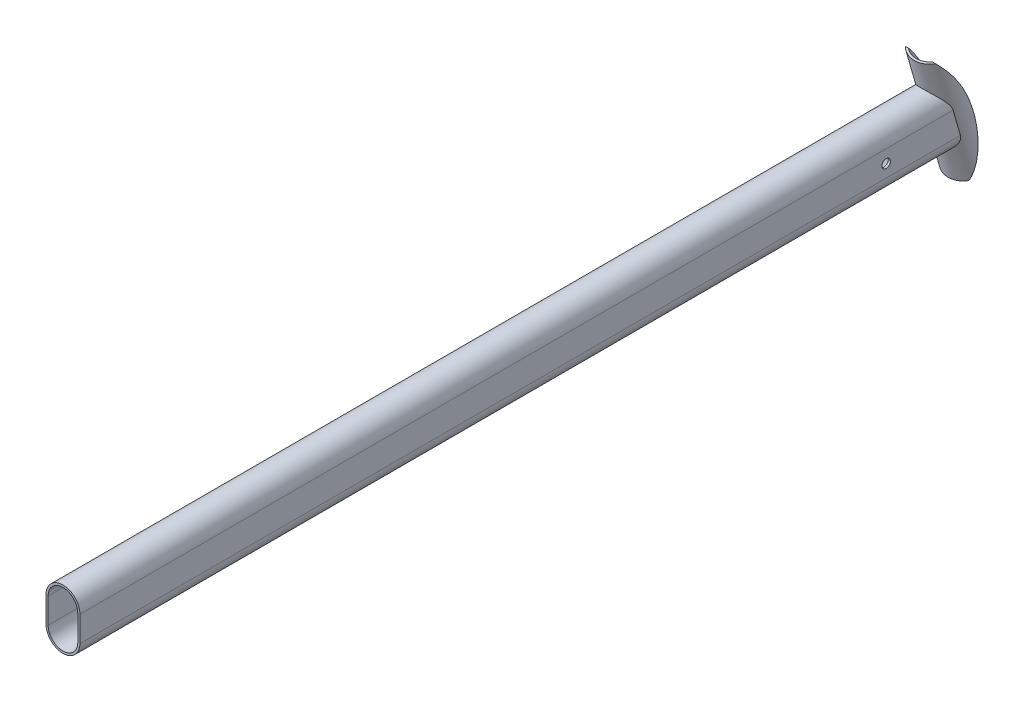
ISO-10303-21;
HEADER;
FILE_DESCRIPTION(('STEP AP214'),'2;1');
FILE_NAME('part.step','',(''),(''),'','','');
FILE_SCHEMA(('AUTOMOTIVE_DESIGN { 1 0 10303 214 1 1 1 1 }'));
ENDSEC;
DATA;
#1=APPLICATION_CONTEXT('core data for automotive mechanical design processes');
#2=APPLICATION_PROTOCOL_DEFINITION('international standard','automotive_design',2000,#1);
#3=PRODUCT_CONTEXT('',#1,'mechanical');
#4=PRODUCT('Part','Part','',(#3));
#5=PRODUCT_RELATED_PRODUCT_CATEGORY('part','',(#4));
#6=PRODUCT_DEFINITION_FORMATION('','',#4);
#7=PRODUCT_DEFINITION_CONTEXT('part definition',#1,'design');
#8=PRODUCT_DEFINITION('design','',#6,#7);
#9=PRODUCT_DEFINITION_SHAPE('','',#8);
#10=(LENGTH_UNIT() NAMED_UNIT(*) SI_UNIT(.MILLI.,.METRE.));
#11=(NAMED_UNIT(*) PLANE_ANGLE_UNIT() SI_UNIT($,.RADIAN.));
#12=(NAMED_UNIT(*) SI_UNIT($,.STERADIAN.) SOLID_ANGLE_UNIT());
#13=UNCERTAINTY_MEASURE_WITH_UNIT(LENGTH_MEASURE(1.E-05),#10,'distance_accuracy_value','');
#14=(GEOMETRIC_REPRESENTATION_CONTEXT(3) GLOBAL_UNCERTAINTY_ASSIGNED_CONTEXT((#13)) GLOBAL_UNIT_ASSIGNED_CONTEXT((#10,
#11,#12)) REPRESENTATION_CONTEXT('',''));
#15=CARTESIAN_POINT('',(0.,0.,0.));
#16=DIRECTION('',(0.,0.,1.));
#17=DIRECTION('',(1.,0.,0.));
#18=AXIS2_PLACEMENT_3D('',#15,#16,#17);
#19=CARTESIAN_POINT('',(19.9999999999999,-48.8378508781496,-8.26912067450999));
#20=DIRECTION('',(0.,0.961261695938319,0.275637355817));
#21=DIRECTION('',(0.,-0.275637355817,0.961261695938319));
#22=AXIS2_PLACEMENT_3D('',#19,#20,#21);
#23=CYLINDRICAL_SURFACE('',#22,25.);
#24=CARTESIAN_POINT('',(2.44947678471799,-53.7452729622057,8.84509398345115));
#25=CARTESIAN_POINT('',(2.28245600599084,-53.4143716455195,8.76869169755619));
#26=CARTESIAN_POINT('',(2.12004642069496,-53.0810314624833,8.69291309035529));
#27=CARTESIAN_POINT('',(1.80403994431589,-52.4099173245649,8.54278644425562));
#28=CARTESIAN_POINT('',(1.65044225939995,-52.0721437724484,8.46843827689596));
#29=CARTESIAN_POINT('',(1.20238132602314,-51.0531411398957,8.24787862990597));
#30=CARTESIAN_POINT('',(0.920458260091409,-50.3658469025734,8.10406334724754));
#31=CARTESIAN_POINT('',(0.387772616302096,-48.9799732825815,7.82439156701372));
#32=CARTESIAN_POINT('',(0.136928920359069,-48.2814288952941,7.68851486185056));
#33=CARTESIAN_POINT('',(-0.337314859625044,-46.87343339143,7.42516608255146));
#34=CARTESIAN_POINT('',(-0.560710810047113,-46.1639806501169,7.29769527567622));
#35=CARTESIAN_POINT('',(-0.980216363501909,-44.7440851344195,7.05324096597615));
#36=CARTESIAN_POINT('',(-1.17660101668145,-44.0337405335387,6.93615686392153));
#37=CARTESIAN_POINT('',(-1.54723077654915,-42.6057764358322,6.71142546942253));
#38=CARTESIAN_POINT('',(-1.72147398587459,-41.8881563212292,6.60377898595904));
#39=CARTESIAN_POINT('',(-2.04997688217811,-40.4463570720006,6.39825978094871));
#40=CARTESIAN_POINT('',(-2.20422009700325,-39.7221730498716,6.30039513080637));
#41=CARTESIAN_POINT('',(-2.49441752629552,-38.2688865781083,6.1148616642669));
#42=CARTESIAN_POINT('',(-2.63037218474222,-37.5397842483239,6.02719260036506));
#43=CARTESIAN_POINT('',(-2.88570395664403,-36.0775107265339,5.86229520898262));
#44=CARTESIAN_POINT('',(-3.00508093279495,-35.3443395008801,5.78506696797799));
#45=CARTESIAN_POINT('',(-3.22881232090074,-33.8746585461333,5.64124002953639));
#46=CARTESIAN_POINT('',(-3.33316606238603,-33.1381486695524,5.57464180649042));
#47=CARTESIAN_POINT('',(-3.62589429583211,-30.924390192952,5.39100933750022));
#48=CARTESIAN_POINT('',(-3.79391185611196,-29.4430533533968,5.29015318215));
#49=CARTESIAN_POINT('',(-4.08583743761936,-26.4732456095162,5.13235863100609));
#50=CARTESIAN_POINT('',(-4.20972691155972,-24.9847719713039,5.07543869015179));
#51=CARTESIAN_POINT('',(-4.42191842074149,-22.0043865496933,5.00598625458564));
#52=CARTESIAN_POINT('',(-4.51022251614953,-20.5124749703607,4.99345118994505));
#53=CARTESIAN_POINT('',(-4.65928468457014,-17.5152552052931,5.01303170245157));
#54=CARTESIAN_POINT('',(-4.71980908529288,-16.0099381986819,5.04551713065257));
#55=CARTESIAN_POINT('',(-4.81878772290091,-13.0002620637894,5.15584327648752));
#56=CARTESIAN_POINT('',(-4.85724186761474,-11.4959029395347,5.23368418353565));
#57=CARTESIAN_POINT('',(-4.91772019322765,-8.49014679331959,5.43465729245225));
#58=CARTESIAN_POINT('',(-4.93974699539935,-6.98874933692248,5.55778226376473));
#59=CARTESIAN_POINT('',(-4.97221444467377,-3.99017090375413,5.84922228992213));
#60=CARTESIAN_POINT('',(-4.98265474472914,-2.49299005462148,6.01753869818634));
#61=CARTESIAN_POINT('',(-4.99399846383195,0.0470560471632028,6.34191214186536));
#62=CARTESIAN_POINT('',(-4.99682385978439,1.09139641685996,6.48648387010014));
#63=CARTESIAN_POINT('',(-4.99995518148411,3.17679798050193,6.79761334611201));
#64=CARTESIAN_POINT('',(-5.00026113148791,4.21785920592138,6.96417088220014));
#65=CARTESIAN_POINT('',(-4.99936435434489,6.29629581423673,7.31920776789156));
#66=CARTESIAN_POINT('',(-4.99816153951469,7.33367097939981,7.50768839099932));
#67=CARTESIAN_POINT('',(-4.99508063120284,9.40422604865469,7.90648194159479));
#68=CARTESIAN_POINT('',(-4.99320253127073,10.4374059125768,8.11679507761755));
#69=CARTESIAN_POINT('',(-4.98943062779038,12.499416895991,8.55922647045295));
#70=CARTESIAN_POINT('',(-4.9875368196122,13.5282465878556,8.79135138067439));
#71=CARTESIAN_POINT('',(-4.98421855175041,15.580779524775,9.27724827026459));
#72=CARTESIAN_POINT('',(-4.98279409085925,16.6044827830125,9.5310201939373));
#73=CARTESIAN_POINT('',(-4.98072165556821,18.6462871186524,10.0600928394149));
#74=CARTESIAN_POINT('',(-4.98007366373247,19.6643883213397,10.3353930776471));
#75=CARTESIAN_POINT('',(-4.97968273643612,21.6945587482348,10.907404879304));
#76=CARTESIAN_POINT('',(-4.97993980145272,22.7066279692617,11.2041164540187));
#77=CARTESIAN_POINT('',(-4.9813081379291,24.7235096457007,11.8185829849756));
#78=CARTESIAN_POINT('',(-4.98241875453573,25.7283270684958,12.1363216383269));
#79=CARTESIAN_POINT('',(-4.98526492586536,27.7310419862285,12.7929041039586));
#80=CARTESIAN_POINT('',(-4.98700048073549,28.728939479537,13.1317479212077));
#81=CARTESIAN_POINT('',(-4.99069074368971,30.7174022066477,13.8304010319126));
#82=CARTESIAN_POINT('',(-4.99264545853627,31.7079672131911,14.1902109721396));
#83=CARTESIAN_POINT('',(-4.99619198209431,33.6812934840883,14.9306268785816));
#84=CARTESIAN_POINT('',(-4.99778379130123,34.6640547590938,15.3112328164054));
#85=CARTESIAN_POINT('',(-4.99984745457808,36.6209996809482,16.0929368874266));
#86=CARTESIAN_POINT('',(-5.00031969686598,37.595186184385,16.4940278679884));
#87=CARTESIAN_POINT('',(-4.99921598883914,39.5348917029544,17.3166442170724));
#88=CARTESIAN_POINT('',(-4.99764003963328,40.5004107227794,17.738169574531));
#89=CARTESIAN_POINT('',(-4.99133828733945,42.4222759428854,18.6014330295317));
#90=CARTESIAN_POINT('',(-4.98661271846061,43.3786228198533,19.0431696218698));
#91=CARTESIAN_POINT('',(-4.97273497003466,45.2817506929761,19.9466676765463));
#92=CARTESIAN_POINT('',(-4.96358288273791,46.2285318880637,20.4084287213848));
#93=CARTESIAN_POINT('',(-4.93687570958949,48.3090857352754,21.4504182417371));
#94=CARTESIAN_POINT('',(-4.91796350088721,49.4405527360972,22.0352253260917));
#95=CARTESIAN_POINT('',(-4.86863245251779,51.6879888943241,23.2333357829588));
#96=CARTESIAN_POINT('',(-4.83821407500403,52.8039586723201,23.846638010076));
#97=CARTESIAN_POINT('',(-4.7625310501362,55.019535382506,25.1012319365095));
#98=CARTESIAN_POINT('',(-4.71726664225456,56.1191425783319,25.7425231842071));
#99=CARTESIAN_POINT('',(-4.60810169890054,58.3010212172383,27.0524748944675));
#100=CARTESIAN_POINT('',(-4.54420109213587,59.3832925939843,27.7211354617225));
#101=CARTESIAN_POINT('',(-4.39394749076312,61.5225289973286,29.0806879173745));
#102=CARTESIAN_POINT('',(-4.30774011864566,62.5796113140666,29.771411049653));
#103=CARTESIAN_POINT('',(-4.10789828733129,64.67428508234,31.1781239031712));
#104=CARTESIAN_POINT('',(-3.99426300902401,65.7118759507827,31.8941143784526));
#105=CARTESIAN_POINT('',(-3.73413482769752,67.765870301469,33.3499427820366));
#106=CARTESIAN_POINT('',(-3.58764550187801,68.7822760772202,34.0897781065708));
#107=CARTESIAN_POINT('',(-3.25558514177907,70.7920724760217,35.5915723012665));
#108=CARTESIAN_POINT('',(-3.07001834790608,71.7854655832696,36.3535287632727));
#109=CARTESIAN_POINT('',(-2.73776561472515,73.3466971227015,37.5821979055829));
#110=CARTESIAN_POINT('',(-2.60610845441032,73.9227909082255,38.0425259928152));
#111=CARTESIAN_POINT('',(-2.3248703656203,75.0655353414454,38.9694645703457));
#112=CARTESIAN_POINT('',(-2.17528887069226,75.6321856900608,39.4360752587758));
#113=CARTESIAN_POINT('',(-1.85649626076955,76.7548967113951,40.3744147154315));
#114=CARTESIAN_POINT('',(-1.68730014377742,77.3109651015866,40.8461393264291));
#115=CARTESIAN_POINT('',(-1.32719087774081,78.4121000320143,41.7940538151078));
#116=CARTESIAN_POINT('',(-1.13627955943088,78.9571674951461,42.2702433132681));
#117=CARTESIAN_POINT('',(-0.728414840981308,80.0409897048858,43.2309070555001));
#118=CARTESIAN_POINT('',(-0.511211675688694,80.5796201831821,43.7154159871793));
#119=CARTESIAN_POINT('',(-0.049906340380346,81.6434571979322,44.6862379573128));
#120=CARTESIAN_POINT('',(0.194192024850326,82.1686656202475,45.1725507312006));
#121=CARTESIAN_POINT('',(0.712721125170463,83.2056391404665,46.1464145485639));
#122=CARTESIAN_POINT('',(0.987226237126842,83.7173673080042,46.6339656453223));
#123=CARTESIAN_POINT('',(1.42366060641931,84.472588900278,47.3635708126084));
#124=CARTESIAN_POINT('',(1.57329564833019,84.7223340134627,47.6065515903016));
#125=CARTESIAN_POINT('',(1.88120490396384,85.2174260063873,48.0915651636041));
#126=CARTESIAN_POINT('',(2.03947985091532,85.462772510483,48.3335978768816));
#127=CARTESIAN_POINT('',(2.20227763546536,85.70578626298,48.5749712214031));
#128=B_SPLINE_CURVE_WITH_KNOTS('',3,(#24,#25,#26,#27,#28,#29,#30,#31,#32,#33,#34,#35,#36,#37,
#38,#39,#40,#41,#42,#43,#44,#45,#46,#47,#48,#49,#50,#51,#52,#53,#54,#55,#56,#57,#58,#59,#60,#61,
#62,#63,#64,#65,#66,#67,#68,#69,#70,#71,#72,#73,#74,#75,#76,#77,#78,#79,#80,#81,#82,#83,#84,#85,
#86,#87,#88,#89,#90,#91,#92,#93,#94,#95,#96,#97,#98,#99,#100,#101,#102,#103,#104,#105,#106,#107,
#108,#109,#110,#111,#112,#113,#114,#115,#116,#117,#118,#119,#120,#121,#122,#123,#124,#125,#126,
#127),.UNSPECIFIED.,.F.,.F.,(4,2,2,2,2,2,2,2,2,2,2,2,2,2,2,2,2,2,2,2,2,2,2,2,2,2,2,2,2,2,2,2,2,
2,2,2,2,2,2,2,2,2,2,2,2,2,2,2,2,2,2,4),(0.,1.13528295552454,2.27046347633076,4.53951315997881,
6.80250988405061,9.06584699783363,11.3040918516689,13.5425283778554,15.7827969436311,
18.0230111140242,20.2632438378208,22.5035765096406,26.9846719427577,31.4676485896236,
35.9503656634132,40.4701281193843,44.9899094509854,49.5089694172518,54.028164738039,
57.1908559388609,60.3535166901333,63.5163612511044,66.6792360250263,69.8430787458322,
73.0069133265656,76.1706768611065,79.3344420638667,82.4957824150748,85.6571235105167,
88.8185621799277,91.9799965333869,95.140334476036,98.3006707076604,101.460771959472,
104.620807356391,108.441751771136,112.262542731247,116.083272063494,119.90401601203,
123.700420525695,127.496938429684,131.293043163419,135.088736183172,137.335719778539,
139.582774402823,141.828122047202,144.073280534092,146.341745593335,148.609890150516,
150.883710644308,152.021240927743,153.158867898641),.UNSPECIFIED.);
#129=CARTESIAN_POINT('',(2.44947678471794,-53.7452729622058,8.84509398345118));
#130=VERTEX_POINT('',#129);
#131=CARTESIAN_POINT('',(2.20227763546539,85.70578626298,48.5749712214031));
#132=VERTEX_POINT('',#131);
#133=EDGE_CURVE('E104',#130,#132,#128,.T.);
#134=ORIENTED_EDGE('',*,*,#133,.F.);
#135=CARTESIAN_POINT('',(19.9999999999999,-48.8378508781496,-8.26912067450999));
#136=DIRECTION('',(0.,0.961261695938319,0.275637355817));
#137=DIRECTION('',(-1.,0.,0.));
#138=AXIS2_PLACEMENT_3D('',#135,#136,#137);
#139=CIRCLE('',#138,25.);
#140=CARTESIAN_POINT('',(37.5505232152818,-53.7452729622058,8.84509398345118));
#141=VERTEX_POINT('',#140);
#142=EDGE_CURVE('E134',#130,#141,#139,.T.);
#143=ORIENTED_EDGE('',*,*,#142,.T.);
#144=CARTESIAN_POINT('',(37.7977223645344,85.70578626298,48.5749712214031));
#145=CARTESIAN_POINT('',(37.9640381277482,85.4575205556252,48.3283812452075));
#146=CARTESIAN_POINT('',(38.1256335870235,85.206820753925,48.0811038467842));
#147=CARTESIAN_POINT('',(38.4398150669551,84.7008368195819,47.5855686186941));
#148=CARTESIAN_POINT('',(38.5924018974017,84.4455531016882,47.3373108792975));
#149=CARTESIAN_POINT('',(39.0371693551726,83.6734796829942,46.5918772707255));
#150=CARTESIAN_POINT('',(39.3165468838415,83.1501820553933,46.0937570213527));
#151=CARTESIAN_POINT('',(39.8436026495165,82.089600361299,45.0989494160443));
#152=CARTESIAN_POINT('',(40.0913625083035,81.5523568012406,44.6022617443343));
#153=CARTESIAN_POINT('',(40.5590040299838,80.4639528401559,43.6108796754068));
#154=CARTESIAN_POINT('',(40.7788815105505,79.9127903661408,43.1161855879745));
#155=CARTESIAN_POINT('',(41.1912732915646,78.803480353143,42.1354132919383));
#156=CARTESIAN_POINT('',(41.3840403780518,78.2454586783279,41.6492984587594));
#157=CARTESIAN_POINT('',(41.7471481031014,77.1180329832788,40.6818496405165));
#158=CARTESIAN_POINT('',(41.9174868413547,76.5486280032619,40.2005160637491));
#159=CARTESIAN_POINT('',(42.2379675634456,75.3988649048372,39.2432869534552));
#160=CARTESIAN_POINT('',(42.3880931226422,74.8184983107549,38.7673961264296));
#161=CARTESIAN_POINT('',(42.6699160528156,73.6479938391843,37.8222756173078));
#162=CARTESIAN_POINT('',(42.8016138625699,73.0578561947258,37.3530457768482));
#163=CARTESIAN_POINT('',(43.0489455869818,71.865539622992,36.4196533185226));
#164=CARTESIAN_POINT('',(43.1644988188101,71.2633162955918,35.9555261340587));
#165=CARTESIAN_POINT('',(43.3804239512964,70.0501274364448,35.0351955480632));
#166=CARTESIAN_POINT('',(43.4807951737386,69.4391615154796,34.5789925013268));
#167=CARTESIAN_POINT('',(43.6678636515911,68.2088940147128,33.6749250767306));
#168=CARTESIAN_POINT('',(43.75455897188,67.5895912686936,33.2270618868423));
#169=CARTESIAN_POINT('',(43.9156319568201,66.3431375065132,32.3401132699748));
#170=CARTESIAN_POINT('',(43.9900092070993,65.7159862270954,31.9010281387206));
#171=CARTESIAN_POINT('',(44.1966473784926,63.8228111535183,30.5970864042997));
#172=CARTESIAN_POINT('',(44.3123476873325,62.5455201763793,29.7458772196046));
#173=CARTESIAN_POINT('',(44.5086142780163,59.9636665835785,28.0820303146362));
#174=CARTESIAN_POINT('',(44.5891826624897,58.6591056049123,27.2693902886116));
#175=CARTESIAN_POINT('',(44.723389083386,56.015053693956,25.6782715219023));
#176=CARTESIAN_POINT('',(44.7768276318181,54.675378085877,24.900083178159));
#177=CARTESIAN_POINT('',(44.8626644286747,51.9720594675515,23.385322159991));
#178=CARTESIAN_POINT('',(44.895062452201,50.6084162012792,22.6487499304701));
#179=CARTESIAN_POINT('',(44.9446091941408,47.8590826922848,21.218291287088));
#180=CARTESIAN_POINT('',(44.9617615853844,46.4733978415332,20.5243946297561));
#181=CARTESIAN_POINT('',(44.9857372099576,43.6811256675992,19.1798414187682));
#182=CARTESIAN_POINT('',(44.9925603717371,42.2745381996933,18.5291851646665));
#183=CARTESIAN_POINT('',(45.0004339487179,39.2626736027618,17.1922255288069));
#184=CARTESIAN_POINT('',(45.0006449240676,37.6547708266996,16.5118247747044));
#185=CARTESIAN_POINT('',(44.9977525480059,34.4161827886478,15.2075590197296));
#186=CARTESIAN_POINT('',(44.9946491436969,32.7854971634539,14.5836949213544));
#187=CARTESIAN_POINT('',(44.9884101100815,29.5031538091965,13.3931998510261));
#188=CARTESIAN_POINT('',(44.9852744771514,27.8514937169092,12.8265753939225));
#189=CARTESIAN_POINT('',(44.9809381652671,24.5294089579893,11.7513357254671));
#190=CARTESIAN_POINT('',(44.9797374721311,22.8589844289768,11.2427200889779));
#191=CARTESIAN_POINT('',(44.9798983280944,19.503015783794,10.2845759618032));
#192=CARTESIAN_POINT('',(44.9812574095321,17.8174877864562,9.83499101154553));
#193=CARTESIAN_POINT('',(44.9858199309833,14.4317614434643,8.99487661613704));
#194=CARTESIAN_POINT('',(44.9890233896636,12.7315629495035,8.60434776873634));
#195=CARTESIAN_POINT('',(44.9952273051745,9.31877213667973,7.88286560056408));
#196=CARTESIAN_POINT('',(44.9982277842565,7.60618119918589,7.55190574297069));
#197=CARTESIAN_POINT('',(45.0006729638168,4.17052779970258,6.94991760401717));
#198=CARTESIAN_POINT('',(45.0001177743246,2.44746566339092,6.6788874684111));
#199=CARTESIAN_POINT('',(44.9918423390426,-0.610078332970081,6.2524444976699));
#200=CARTESIAN_POINT('',(44.9857978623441,-1.94286871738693,6.08477528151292));
#201=CARTESIAN_POINT('',(44.9661463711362,-4.61240614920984,5.78530277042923));
#202=CARTESIAN_POINT('',(44.9525395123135,-5.94915311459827,5.65349873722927));
#203=CARTESIAN_POINT('',(44.9146439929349,-8.6254697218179,5.42585929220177));
#204=CARTESIAN_POINT('',(44.8903560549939,-9.96503916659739,5.33002144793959));
#205=CARTESIAN_POINT('',(44.8274807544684,-12.6459516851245,5.17436529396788));
#206=CARTESIAN_POINT('',(44.7888933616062,-13.9872947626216,5.11454706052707));
#207=CARTESIAN_POINT('',(44.6935162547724,-16.6636468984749,5.03116306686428));
#208=CARTESIAN_POINT('',(44.6368200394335,-17.9986535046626,5.00741462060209));
#209=CARTESIAN_POINT('',(44.5005077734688,-20.6677064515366,4.99554972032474));
#210=CARTESIAN_POINT('',(44.4208913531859,-22.0017527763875,5.00743384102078));
#211=CARTESIAN_POINT('',(44.2333989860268,-24.6674096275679,5.06670486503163));
#212=CARTESIAN_POINT('',(44.1255165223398,-25.9990195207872,5.11409996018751));
#213=CARTESIAN_POINT('',(43.8754184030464,-28.6572950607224,5.24412651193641));
#214=CARTESIAN_POINT('',(43.7332046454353,-29.983960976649,5.32675602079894));
#215=CARTESIAN_POINT('',(43.4511655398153,-32.2743006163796,5.49988866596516));
#216=CARTESIAN_POINT('',(43.3209557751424,-33.2397748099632,5.58231770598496));
#217=CARTESIAN_POINT('',(43.0352762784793,-35.1652322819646,5.76545047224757));
#218=CARTESIAN_POINT('',(42.8798076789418,-36.1252158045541,5.86615337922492));
#219=CARTESIAN_POINT('',(42.540339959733,-38.0368511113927,6.08527140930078));
#220=CARTESIAN_POINT('',(42.356377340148,-38.988511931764,6.20366386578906));
#221=CARTESIAN_POINT('',(41.9558528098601,-40.8827832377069,6.45767429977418));
#222=CARTESIAN_POINT('',(41.739287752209,-41.8253928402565,6.59329393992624));
#223=CARTESIAN_POINT('',(41.2663016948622,-43.7103212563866,6.88267857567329));
#224=CARTESIAN_POINT('',(41.0094258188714,-44.6524956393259,7.03664513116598));
#225=CARTESIAN_POINT('',(40.4526792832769,-46.5212111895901,7.36015507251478));
#226=CARTESIAN_POINT('',(40.1528207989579,-47.4477567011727,7.52969404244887));
#227=CARTESIAN_POINT('',(39.6657154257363,-48.8245250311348,7.7948140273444));
#228=CARTESIAN_POINT('',(39.4967181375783,-49.2822557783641,7.88519808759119));
#229=CARTESIAN_POINT('',(39.1455855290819,-50.1919851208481,8.06920226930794));
#230=CARTESIAN_POINT('',(38.9634508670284,-50.6439840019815,8.16282222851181));
#231=CARTESIAN_POINT('',(38.5850036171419,-51.5419237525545,8.35308471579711));
#232=CARTESIAN_POINT('',(38.3886771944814,-51.9878581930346,8.44973013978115));
#233=CARTESIAN_POINT('',(37.981052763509,-52.8723532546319,8.6455874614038));
#234=CARTESIAN_POINT('',(37.769752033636,-53.3109125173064,8.74479982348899));
#235=CARTESIAN_POINT('',(37.5505232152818,-53.7452729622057,8.84509398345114));
#236=B_SPLINE_CURVE_WITH_KNOTS('',3,(#144,#145,#146,#147,#148,#149,#150,#151,#152,#153,#154,
#155,#156,#157,#158,#159,#160,#161,#162,#163,#164,#165,#166,#167,#168,#169,#170,#171,#172,#173,
#174,#175,#176,#177,#178,#179,#180,#181,#182,#183,#184,#185,#186,#187,#188,#189,#190,#191,#192,
#193,#194,#195,#196,#197,#198,#199,#200,#201,#202,#203,#204,#205,#206,#207,#208,#209,#210,#211,
#212,#213,#214,#215,#216,#217,#218,#219,#220,#221,#222,#223,#224,#225,#226,#227,#228,#229,#230,
#231,#232,#233,#234,#235),.UNSPECIFIED.,.F.,.F.,(4,2,2,2,2,2,2,2,2,2,2,2,2,2,2,2,2,2,2,2,2,2,2,
2,2,2,2,2,2,2,2,2,2,2,2,2,2,2,2,2,2,2,2,2,2,4),(0.,1.16220907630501,2.32431352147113,
4.64718796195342,6.96393902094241,9.28103718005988,11.5748490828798,13.8688552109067,
16.1647142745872,18.4605186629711,20.7674146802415,23.0744137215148,25.3817389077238,
27.6891416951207,32.3056483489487,36.9218786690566,41.571577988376,46.2213270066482,
50.8699555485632,55.5186162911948,60.7553335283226,65.9921343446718,71.2295305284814,
76.4668883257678,81.6991998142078,86.9315642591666,92.1633541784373,97.3949822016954,
101.424438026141,105.45381089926,109.482911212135,113.512020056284,117.52065343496,
121.529351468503,125.538974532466,129.548375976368,132.481016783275,135.413526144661,
138.342309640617,141.271376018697,144.236250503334,147.200286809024,148.688805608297,
150.177249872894,151.66716524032,153.157352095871),.UNSPECIFIED.);
#237=CARTESIAN_POINT('',(37.7977223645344,85.7057862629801,48.5749712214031));
#238=VERTEX_POINT('',#237);
#239=EDGE_CURVE('E138',#238,#141,#236,.T.);
#240=ORIENTED_EDGE('',*,*,#239,.F.);
#241=CARTESIAN_POINT('',(19.9999999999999,90.5450950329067,31.698295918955));
#242=DIRECTION('',(0.,0.961261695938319,0.275637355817));
#243=DIRECTION('',(-1.,0.,0.));
#244=AXIS2_PLACEMENT_3D('',#241,#242,#243);
#245=CIRCLE('',#244,25.);
#246=EDGE_CURVE('E136',#132,#238,#245,.T.);
#247=ORIENTED_EDGE('',*,*,#246,.F.);
#248=EDGE_LOOP('',(#134,#143,#240,#247));
#249=FACE_BOUND('',#248,.T.);
#250=ADVANCED_FACE('F82',(#249),#23,.T.);
#251=CARTESIAN_POINT('',(19.9999999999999,-48.8378508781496,-8.26912067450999));
#252=DIRECTION('',(0.,0.961261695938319,0.275637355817));
#253=DIRECTION('',(0.,-0.275637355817,0.961261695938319));
#254=AXIS2_PLACEMENT_3D('',#251,#252,#253);
#255=PLANE('',#254);
#256=ORIENTED_EDGE('',*,*,#142,.F.);
#257=DIRECTION('',(1.,0.,0.));
#258=VECTOR('',#257,1.);
#259=CARTESIAN_POINT('',(-5.00000000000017,-53.7452729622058,8.84509398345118));
#260=LINE('',#259,#258);
#261=CARTESIAN_POINT('',(6.24242517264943,-53.7452729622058,8.84509398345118));
#262=VERTEX_POINT('',#261);
#263=EDGE_CURVE('E120',#130,#262,#260,.T.);
#264=ORIENTED_EDGE('',*,*,#263,.T.);
#265=CARTESIAN_POINT('',(19.9999999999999,-48.8378508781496,-8.26912067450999));
#266=DIRECTION('',(0.,0.961261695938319,0.275637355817));
#267=DIRECTION('',(0.,-0.275637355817,0.961261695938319));
#268=AXIS2_PLACEMENT_3D('',#265,#266,#267);
#269=CIRCLE('',#268,22.5);
#270=CARTESIAN_POINT('',(33.7575748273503,-53.7452729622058,8.84509398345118));
#271=VERTEX_POINT('',#270);
#272=EDGE_CURVE('E142',#262,#271,#269,.T.);
#273=ORIENTED_EDGE('',*,*,#272,.T.);
#274=EDGE_CURVE('E128',#271,#141,#260,.T.);
#275=ORIENTED_EDGE('',*,*,#274,.T.);
#276=EDGE_LOOP('',(#256,#264,#273,#275));
#277=FACE_BOUND('',#276,.T.);
#278=ADVANCED_FACE('F141',(#277),#255,.F.);
#279=CARTESIAN_POINT('',(19.9999999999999,-48.8378508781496,-8.26912067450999));
#280=DIRECTION('',(0.,0.961261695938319,0.275637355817));
#281=DIRECTION('',(0.,-0.275637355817,0.961261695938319));
#282=AXIS2_PLACEMENT_3D('',#279,#280,#281);
#283=CYLINDRICAL_SURFACE('',#282,22.5);
#284=ORIENTED_EDGE('',*,*,#272,.F.);
#285=CARTESIAN_POINT('',(6.24242517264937,-53.7452729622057,8.84509398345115));
#286=CARTESIAN_POINT('',(6.08598948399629,-53.5023249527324,8.78899953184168));
#287=CARTESIAN_POINT('',(5.93312140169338,-53.2570831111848,8.73301545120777));
#288=CARTESIAN_POINT('',(5.63424990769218,-52.7624000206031,8.62141761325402));
#289=CARTESIAN_POINT('',(5.48824583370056,-52.5129591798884,8.5658038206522));
#290=CARTESIAN_POINT('',(5.06025721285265,-51.7591620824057,8.39979484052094));
#291=CARTESIAN_POINT('',(4.78810231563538,-51.2490280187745,8.29016188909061));
#292=CARTESIAN_POINT('',(4.26874571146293,-50.2175075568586,8.07423910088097));
#293=CARTESIAN_POINT('',(4.02147456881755,-49.6961576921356,7.96794056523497));
#294=CARTESIAN_POINT('',(3.54900891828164,-48.642732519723,7.75910130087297));
#295=CARTESIAN_POINT('',(3.32381798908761,-48.1106554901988,7.65656118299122));
#296=CARTESIAN_POINT('',(2.8966135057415,-47.0446427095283,7.45720120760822));
#297=CARTESIAN_POINT('',(2.69433326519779,-46.5108241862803,7.36032371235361));
#298=CARTESIAN_POINT('',(2.30797926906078,-45.4357726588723,7.1713174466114));
#299=CARTESIAN_POINT('',(2.12390719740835,-44.894538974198,7.07918911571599));
#300=CARTESIAN_POINT('',(1.77239337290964,-43.8053752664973,6.9000035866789));
#301=CARTESIAN_POINT('',(1.60496548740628,-43.2574400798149,6.81295064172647));
#302=CARTESIAN_POINT('',(1.28557930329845,-42.1562330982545,6.64430659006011));
#303=CARTESIAN_POINT('',(1.13362200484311,-41.602960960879,6.56271583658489));
#304=CARTESIAN_POINT('',(0.704806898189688,-39.9582466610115,6.32963417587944));
#305=CARTESIAN_POINT('',(0.448175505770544,-38.8603303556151,6.18627842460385));
#306=CARTESIAN_POINT('',(-0.0185279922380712,-36.651823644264,5.92299174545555));
#307=CARTESIAN_POINT('',(-0.228590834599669,-35.5412307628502,5.80306547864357));
#308=CARTESIAN_POINT('',(-0.609082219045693,-33.310537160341,5.58753164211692));
#309=CARTESIAN_POINT('',(-0.779495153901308,-32.190432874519,5.49193364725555));
#310=CARTESIAN_POINT('',(-1.08650105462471,-29.9438830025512,5.325727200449));
#311=CARTESIAN_POINT('',(-1.22309599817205,-28.8174377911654,5.25511728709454));
#312=CARTESIAN_POINT('',(-1.46885765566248,-26.5487041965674,5.13867147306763));
#313=CARTESIAN_POINT('',(-1.57773143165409,-25.4063711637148,5.09309471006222));
#314=CARTESIAN_POINT('',(-1.77083870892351,-23.1189100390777,5.02806378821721));
#315=CARTESIAN_POINT('',(-1.8550721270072,-21.9737819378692,5.00860971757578));
#316=CARTESIAN_POINT('',(-2.00293815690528,-19.6822565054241,4.99596108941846));
#317=CARTESIAN_POINT('',(-2.06657402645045,-18.5358594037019,5.00276237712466));
#318=CARTESIAN_POINT('',(-2.1768409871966,-16.2426778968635,5.04268051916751));
#319=CARTESIAN_POINT('',(-2.22347146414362,-15.0958934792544,5.07579832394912));
#320=CARTESIAN_POINT('',(-2.29902815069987,-12.9143617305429,5.1638666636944));
#321=CARTESIAN_POINT('',(-2.32923461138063,-11.8795584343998,5.21638231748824));
#322=CARTESIAN_POINT('',(-2.38043931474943,-9.81100872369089,5.34286449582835));
#323=CARTESIAN_POINT('',(-2.40143729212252,-8.7772623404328,5.41683163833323));
#324=CARTESIAN_POINT('',(-2.43608747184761,-6.71129369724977,5.58619661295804));
#325=CARTESIAN_POINT('',(-2.44973886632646,-5.67907161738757,5.68159680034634));
#326=CARTESIAN_POINT('',(-2.47135195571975,-3.61677899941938,5.89378087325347));
#327=CARTESIAN_POINT('',(-2.47931369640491,-2.58670844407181,6.01056458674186));
#328=CARTESIAN_POINT('',(-2.49101917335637,-0.528659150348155,6.26552993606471));
#329=CARTESIAN_POINT('',(-2.49476073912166,0.499318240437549,6.4037225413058));
#330=CARTESIAN_POINT('',(-2.49930397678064,2.55219277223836,6.70140145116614));
#331=CARTESIAN_POINT('',(-2.50010564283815,3.57708990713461,6.8608877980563));
#332=CARTESIAN_POINT('',(-2.49987261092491,5.62330875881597,7.20107684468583));
#333=CARTESIAN_POINT('',(-2.49883799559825,6.64463063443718,7.38177858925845));
#334=CARTESIAN_POINT('',(-2.49585518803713,8.68330437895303,7.76432605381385));
#335=CARTESIAN_POINT('',(-2.49390699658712,9.70065625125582,7.96617175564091));
#336=CARTESIAN_POINT('',(-2.4898438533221,11.7282374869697,8.39035220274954));
#337=CARTESIAN_POINT('',(-2.48772936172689,12.7384786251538,8.61263067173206));
#338=CARTESIAN_POINT('',(-2.48388378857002,14.7541477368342,9.07803764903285));
#339=CARTESIAN_POINT('',(-2.4821527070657,15.7595757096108,9.32116616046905));
#340=CARTESIAN_POINT('',(-2.4794467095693,17.7652067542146,9.8281739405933));
#341=CARTESIAN_POINT('',(-2.47847180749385,18.7654097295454,10.0920535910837));
#342=CARTESIAN_POINT('',(-2.47746770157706,20.7601427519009,10.6404465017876));
#343=CARTESIAN_POINT('',(-2.47743849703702,21.7546728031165,10.9249597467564));
#344=CARTESIAN_POINT('',(-2.47833117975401,23.7372472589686,11.5143829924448));
#345=CARTESIAN_POINT('',(-2.47925269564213,24.7252940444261,11.8192849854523));
#346=CARTESIAN_POINT('',(-2.48186762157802,26.6948726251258,12.4494546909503));
#347=CARTESIAN_POINT('',(-2.4835610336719,27.6764044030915,12.7747224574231));
#348=CARTESIAN_POINT('',(-2.48735953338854,29.6324975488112,13.4454727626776));
#349=CARTESIAN_POINT('',(-2.48946460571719,30.6070591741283,13.7909545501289));
#350=CARTESIAN_POINT('',(-2.49353883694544,32.5488123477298,14.5019880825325));
#351=CARTESIAN_POINT('',(-2.49550799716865,33.5160039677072,14.8675396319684));
#352=CARTESIAN_POINT('',(-2.49948356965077,35.9901099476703,15.8319839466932));
#353=CARTESIAN_POINT('',(-2.50087519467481,37.4913828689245,16.4454252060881));
#354=CARTESIAN_POINT('',(-2.49793605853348,40.4731895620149,17.7206398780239));
#355=CARTESIAN_POINT('',(-2.49360543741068,41.9537238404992,18.3824121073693));
#356=CARTESIAN_POINT('',(-2.47445298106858,44.8930153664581,19.7538265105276));
#357=CARTESIAN_POINT('',(-2.4596275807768,46.3517650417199,20.4634848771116));
#358=CARTESIAN_POINT('',(-2.4136107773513,49.2452880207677,21.9296407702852));
#359=CARTESIAN_POINT('',(-2.38241945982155,50.680061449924,22.6861380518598));
#360=CARTESIAN_POINT('',(-2.29658694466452,53.5245851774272,24.2453919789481));
#361=CARTESIAN_POINT('',(-2.24193285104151,54.934321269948,25.0481738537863));
#362=CARTESIAN_POINT('',(-2.10078282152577,57.7260256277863,26.6984263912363));
#363=CARTESIAN_POINT('',(-2.01428487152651,59.1079921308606,27.5458998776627));
#364=CARTESIAN_POINT('',(-1.85319920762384,61.1574535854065,28.8488103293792));
#365=CARTESIAN_POINT('',(-1.79430993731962,61.8364324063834,29.2882196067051));
#366=CARTESIAN_POINT('',(-1.6646442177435,63.1863987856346,30.177421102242));
#367=CARTESIAN_POINT('',(-1.59386815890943,63.8573866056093,30.6272129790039));
#368=CARTESIAN_POINT('',(-1.4388924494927,65.1908568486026,31.5367698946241));
#369=CARTESIAN_POINT('',(-1.35469483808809,65.8533405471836,31.9965334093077));
#370=CARTESIAN_POINT('',(-1.17116352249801,67.1693935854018,32.9256555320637));
#371=CARTESIAN_POINT('',(-1.07183050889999,67.822963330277,33.3950137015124));
#372=CARTESIAN_POINT('',(-0.860621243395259,69.0937030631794,34.3231374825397));
#373=CARTESIAN_POINT('',(-0.749437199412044,69.7112575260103,34.7815335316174));
#374=CARTESIAN_POINT('',(-0.509600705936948,70.9370822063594,35.7060923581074));
#375=CARTESIAN_POINT('',(-0.380948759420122,71.545352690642,36.1722549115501));
#376=CARTESIAN_POINT('',(-0.104090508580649,72.7521715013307,37.1118339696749));
#377=CARTESIAN_POINT('',(0.044123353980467,73.3507159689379,37.5852532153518));
#378=CARTESIAN_POINT('',(0.362326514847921,74.5370143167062,38.5382819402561));
#379=CARTESIAN_POINT('',(0.532315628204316,75.1247682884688,39.0178913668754));
#380=CARTESIAN_POINT('',(0.895401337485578,76.2846863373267,39.9790335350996));
#381=CARTESIAN_POINT('',(1.08833929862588,76.8569273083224,40.4605331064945));
#382=CARTESIAN_POINT('',(1.50098754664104,77.9886435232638,41.4272060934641));
#383=CARTESIAN_POINT('',(1.72069978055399,78.5481178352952,41.912379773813));
#384=CARTESIAN_POINT('',(2.18977716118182,79.6522762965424,42.884148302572));
#385=CARTESIAN_POINT('',(2.43911476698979,80.1969736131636,43.3707414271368));
#386=CARTESIAN_POINT('',(2.9710391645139,81.2701928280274,44.3434496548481));
#387=CARTESIAN_POINT('',(3.25361725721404,81.7987189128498,44.8295648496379));
#388=CARTESIAN_POINT('',(3.7259807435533,82.6132484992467,45.589376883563));
#389=CARTESIAN_POINT('',(3.90319745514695,82.9055002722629,45.8642283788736));
#390=CARTESIAN_POINT('',(4.27041429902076,83.4835037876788,46.4121417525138));
#391=CARTESIAN_POINT('',(4.46041244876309,83.7692565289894,46.6852039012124));
#392=CARTESIAN_POINT('',(4.85474763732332,84.3347411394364,47.2297985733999));
#393=CARTESIAN_POINT('',(5.0591342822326,84.6144473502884,47.5013219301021));
#394=CARTESIAN_POINT('',(5.48257341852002,85.1661222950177,48.0409605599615));
#395=CARTESIAN_POINT('',(5.70163004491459,85.4380888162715,48.3090748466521));
#396=CARTESIAN_POINT('',(5.92843571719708,85.70578626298,48.5749712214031));
#397=B_SPLINE_CURVE_WITH_KNOTS('',3,(#285,#286,#287,#288,#289,#290,#291,#292,#293,#294,#295,
#296,#297,#298,#299,#300,#301,#302,#303,#304,#305,#306,#307,#308,#309,#310,#311,#312,#313,#314,
#315,#316,#317,#318,#319,#320,#321,#322,#323,#324,#325,#326,#327,#328,#329,#330,#331,#332,#333,
#334,#335,#336,#337,#338,#339,#340,#341,#342,#343,#344,#345,#346,#347,#348,#349,#350,#351,#352,
#353,#354,#355,#356,#357,#358,#359,#360,#361,#362,#363,#364,#365,#366,#367,#368,#369,#370,#371,
#372,#373,#374,#375,#376,#377,#378,#379,#380,#381,#382,#383,#384,#385,#386,#387,#388,#389,#390,
#391,#392,#393,#394,#395,#396),.UNSPECIFIED.,.F.,.F.,(4,2,2,2,2,2,2,2,2,2,2,2,2,2,2,2,2,2,2,2,2,
2,2,2,2,2,2,2,2,2,2,2,2,2,2,2,2,2,2,2,2,2,2,2,2,2,2,2,2,2,2,2,2,2,2,4),(0.,0.882981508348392,
1.76587764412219,3.53057114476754,5.29019531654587,7.05010421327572,8.78678411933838,
10.5236244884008,12.2619000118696,14.0002878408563,17.4084345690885,20.8172586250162,
24.2274222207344,27.6373863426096,31.0820145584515,34.5266544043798,37.9707491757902,
41.4149683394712,44.5244279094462,47.6339770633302,50.7438680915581,53.8537341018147,
56.9651988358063,60.0766697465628,63.1880006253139,66.2993288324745,69.4023308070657,
72.5053332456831,75.6083927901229,78.711450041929,81.8132956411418,84.9151494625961,
88.0168880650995,91.1185964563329,95.9829887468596,100.847261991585,105.713188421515,
110.579089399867,115.447668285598,120.316555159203,122.749101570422,125.181568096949,
127.613665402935,130.045651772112,132.376642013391,134.707565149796,137.039391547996,
139.371198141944,141.687732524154,144.004435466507,146.319001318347,148.632962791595,
149.948528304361,151.26389022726,152.584032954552,153.90454936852),.UNSPECIFIED.);
#398=CARTESIAN_POINT('',(5.92843571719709,85.7057862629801,48.5749712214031));
#399=VERTEX_POINT('',#398);
#400=EDGE_CURVE('E123',#262,#399,#397,.T.);
#401=ORIENTED_EDGE('',*,*,#400,.T.);
#402=CARTESIAN_POINT('',(19.9999999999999,90.5450950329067,31.698295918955));
#403=DIRECTION('',(0.,0.961261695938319,0.275637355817));
#404=DIRECTION('',(0.,-0.275637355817,0.961261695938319));
#405=AXIS2_PLACEMENT_3D('',#402,#403,#404);
#406=CIRCLE('',#405,22.5);
#407=CARTESIAN_POINT('',(34.0715642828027,85.70578626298,48.5749712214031));
#408=VERTEX_POINT('',#407);
#409=EDGE_CURVE('E137',#399,#408,#406,.T.);
#410=ORIENTED_EDGE('',*,*,#409,.T.);
#411=CARTESIAN_POINT('',(34.0715642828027,85.70578626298,48.5749712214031));
#412=CARTESIAN_POINT('',(34.2281078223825,85.5210320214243,48.3914642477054));
#413=CARTESIAN_POINT('',(34.380951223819,85.3342405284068,48.2068923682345));
#414=CARTESIAN_POINT('',(34.6795308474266,84.9568388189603,47.8359578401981));
#415=CARTESIAN_POINT('',(34.8252677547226,84.7662289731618,47.6495953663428));
#416=CARTESIAN_POINT('',(35.2521266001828,84.1892391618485,47.0885082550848));
#417=CARTESIAN_POINT('',(35.5230893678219,83.7974699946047,46.7115563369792));
#418=CARTESIAN_POINT('',(36.0393502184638,83.0024587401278,45.9550834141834));
#419=CARTESIAN_POINT('',(36.2847189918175,82.5992523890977,45.575572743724));
#420=CARTESIAN_POINT('',(36.7527830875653,81.7815729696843,44.8145954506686));
#421=CARTESIAN_POINT('',(36.9754747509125,81.367098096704,44.4331285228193));
#422=CARTESIAN_POINT('',(37.3972758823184,80.5335117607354,43.674681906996));
#423=CARTESIAN_POINT('',(37.5966536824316,80.1145300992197,43.2977081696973));
#424=CARTESIAN_POINT('',(37.9768021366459,79.2676051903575,42.5443918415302));
#425=CARTESIAN_POINT('',(38.1575711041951,78.8396611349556,42.1680493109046));
#426=CARTESIAN_POINT('',(38.5021492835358,77.9752447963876,41.4166402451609));
#427=CARTESIAN_POINT('',(38.6659444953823,77.5387658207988,41.0415750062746));
#428=CARTESIAN_POINT('',(38.977803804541,76.6582404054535,40.2937736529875));
#429=CARTESIAN_POINT('',(39.1258668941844,76.2141934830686,39.9210376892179));
#430=CARTESIAN_POINT('',(39.5463988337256,74.8778931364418,38.8125745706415));
#431=CARTESIAN_POINT('',(39.7976352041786,73.9752817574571,38.0811999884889));
#432=CARTESIAN_POINT('',(40.2520107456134,72.1457783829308,36.6339705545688));
#433=CARTESIAN_POINT('',(40.455140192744,71.2188815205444,35.9181188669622));
#434=CARTESIAN_POINT('',(40.820764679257,69.3430867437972,34.5043871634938));
#435=CARTESIAN_POINT('',(40.9832432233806,68.3941800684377,33.8065145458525));
#436=CARTESIAN_POINT('',(41.2738232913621,66.4767981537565,32.4310171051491));
#437=CARTESIAN_POINT('',(41.4019268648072,65.5083240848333,31.7533910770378));
#438=CARTESIAN_POINT('',(41.6304207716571,63.5434746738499,30.4130166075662));
#439=CARTESIAN_POINT('',(41.7305186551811,62.5469164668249,29.7504870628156));
#440=CARTESIAN_POINT('',(41.9062053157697,60.5367191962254,28.4485443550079));
#441=CARTESIAN_POINT('',(41.981794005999,59.5230800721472,27.8091312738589));
#442=CARTESIAN_POINT('',(42.1127711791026,57.479992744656,26.5543393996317));
#443=CARTESIAN_POINT('',(42.1681628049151,56.450547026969,25.9389568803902));
#444=CARTESIAN_POINT('',(42.262564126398,54.3765994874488,24.7327340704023));
#445=CARTESIAN_POINT('',(42.3015732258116,53.3320971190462,24.14189467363));
#446=CARTESIAN_POINT('',(42.3623207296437,51.3658511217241,23.0606011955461));
#447=CARTESIAN_POINT('',(42.3856465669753,50.4458322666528,22.5670934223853));
#448=CARTESIAN_POINT('',(42.4243870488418,48.5955370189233,21.5993164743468));
#449=CARTESIAN_POINT('',(42.4398014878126,47.665260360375,21.1250477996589));
#450=CARTESIAN_POINT('',(42.4644669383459,45.7948517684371,20.1959644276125));
#451=CARTESIAN_POINT('',(42.4737173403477,44.8547188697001,19.7411516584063));
#452=CARTESIAN_POINT('',(42.4875995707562,42.9651399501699,18.8512513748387));
#453=CARTESIAN_POINT('',(42.4922314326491,42.0156939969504,18.4161637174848));
#454=CARTESIAN_POINT('',(42.4982340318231,40.1074701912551,17.5657113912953));
#455=CARTESIAN_POINT('',(42.4996032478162,39.1486881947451,17.150356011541));
#456=CARTESIAN_POINT('',(42.5002459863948,37.2226529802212,16.3397690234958));
#457=CARTESIAN_POINT('',(42.4995195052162,36.2553997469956,15.9445374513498));
#458=CARTESIAN_POINT('',(42.496954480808,34.3128875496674,15.1743878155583));
#459=CARTESIAN_POINT('',(42.4951159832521,33.3376289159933,14.7994689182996));
#460=CARTESIAN_POINT('',(42.4911240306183,31.3794923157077,14.0700906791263));
#461=CARTESIAN_POINT('',(42.4889705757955,30.3966143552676,13.7156313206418));
#462=CARTESIAN_POINT('',(42.4849637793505,28.4264501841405,13.0282973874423));
#463=CARTESIAN_POINT('',(42.4831096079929,27.4391842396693,12.6953647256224));
#464=CARTESIAN_POINT('',(42.480111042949,25.4579286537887,12.0501411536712));
#465=CARTESIAN_POINT('',(42.478966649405,24.4639390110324,11.7378502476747));
#466=CARTESIAN_POINT('',(42.4776162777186,22.4696470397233,11.1340396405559));
#467=CARTESIAN_POINT('',(42.4774103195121,21.469344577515,10.8425203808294));
#468=CARTESIAN_POINT('',(42.477976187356,19.4628840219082,10.2803874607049));
#469=CARTESIAN_POINT('',(42.4787480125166,18.45672593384,10.0097737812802));
#470=CARTESIAN_POINT('',(42.4811189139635,16.4393744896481,9.48966831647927));
#471=CARTESIAN_POINT('',(42.4827176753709,15.4281831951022,9.24016853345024));
#472=CARTESIAN_POINT('',(42.486403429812,13.4008214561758,8.76228332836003));
#473=CARTESIAN_POINT('',(42.4884904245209,12.384650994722,8.53389797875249));
#474=CARTESIAN_POINT('',(42.4926275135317,10.3478191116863,8.09835124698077));
#475=CARTESIAN_POINT('',(42.4946776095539,9.32715790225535,7.89118887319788));
#476=CARTESIAN_POINT('',(42.4980258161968,7.2817618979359,7.49816943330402));
#477=CARTESIAN_POINT('',(42.4993239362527,6.2570271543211,7.31231209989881));
#478=CARTESIAN_POINT('',(42.5005055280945,3.73297814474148,6.88162391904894));
#479=CARTESIAN_POINT('',(42.4994669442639,2.23158866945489,6.64884841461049));
#480=CARTESIAN_POINT('',(42.4904468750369,-0.777490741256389,6.22902557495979));
#481=CARTESIAN_POINT('',(42.4824656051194,-2.28518047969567,6.04197682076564));
#482=CARTESIAN_POINT('',(42.4552293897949,-5.30583965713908,5.71373065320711));
#483=CARTESIAN_POINT('',(42.4359716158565,-6.81881032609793,5.57254475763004));
#484=CARTESIAN_POINT('',(42.3809828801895,-9.84806520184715,5.33622283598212));
#485=CARTESIAN_POINT('',(42.345251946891,-11.3643494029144,5.24108673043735));
#486=CARTESIAN_POINT('',(42.2511427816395,-14.3993682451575,5.09688987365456));
#487=CARTESIAN_POINT('',(42.1927505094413,-15.9181038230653,5.04785775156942));
#488=CARTESIAN_POINT('',(42.0461025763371,-18.9551043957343,4.9959521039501));
#489=CARTESIAN_POINT('',(41.957845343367,-20.4733693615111,4.99308100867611));
#490=CARTESIAN_POINT('',(41.7967144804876,-22.7476882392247,5.02325254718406));
#491=CARTESIAN_POINT('',(41.738237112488,-23.5050349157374,5.03904532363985));
#492=CARTESIAN_POINT('',(41.6104817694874,-25.0184843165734,5.08206308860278));
#493=CARTESIAN_POINT('',(41.5412041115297,-25.7745870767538,5.10928774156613));
#494=CARTESIAN_POINT('',(41.3905547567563,-27.2849980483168,5.17510166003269));
#495=CARTESIAN_POINT('',(41.3091846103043,-28.0393064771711,5.21368946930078));
#496=CARTESIAN_POINT('',(41.1329163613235,-29.5456582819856,5.30213897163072));
#497=CARTESIAN_POINT('',(41.0380187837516,-30.297701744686,5.35200022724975));
#498=CARTESIAN_POINT('',(40.8330013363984,-31.7998287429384,5.46294141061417));
#499=CARTESIAN_POINT('',(40.7228630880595,-32.5499087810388,5.52403491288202));
#500=CARTESIAN_POINT('',(40.4857225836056,-34.046409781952,5.65723100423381));
#501=CARTESIAN_POINT('',(40.3587207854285,-34.7928308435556,5.72933329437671));
#502=CARTESIAN_POINT('',(40.0858894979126,-36.2813755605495,5.8843505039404));
#503=CARTESIAN_POINT('',(39.9400536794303,-37.0234976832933,5.96726905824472));
#504=CARTESIAN_POINT('',(39.6274605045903,-38.5020845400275,6.14360222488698));
#505=CARTESIAN_POINT('',(39.4607032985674,-39.2385493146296,6.23701676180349));
#506=CARTESIAN_POINT('',(39.1050363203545,-40.6997935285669,6.43331974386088));
#507=CARTESIAN_POINT('',(38.9162749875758,-41.4246175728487,6.53614380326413));
#508=CARTESIAN_POINT('',(38.5131427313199,-42.8657786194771,6.75126663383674));
#509=CARTESIAN_POINT('',(38.298770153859,-43.5821150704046,6.86356601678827));
#510=CARTESIAN_POINT('',(37.8417018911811,-45.0036443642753,7.09686909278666));
#511=CARTESIAN_POINT('',(37.5990291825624,-45.7088457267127,7.21786569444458));
#512=CARTESIAN_POINT('',(37.082016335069,-47.1060306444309,7.46774448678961));
#513=CARTESIAN_POINT('',(36.807683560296,-47.7980172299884,7.59662484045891));
#514=CARTESIAN_POINT('',(36.3210798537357,-48.9375578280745,7.81700704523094));
#515=CARTESIAN_POINT('',(36.1186191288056,-49.3896731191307,7.90664190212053));
#516=CARTESIAN_POINT('',(35.6968559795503,-50.2853692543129,8.08844433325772));
#517=CARTESIAN_POINT('',(35.4775570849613,-50.7289518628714,8.18061137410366));
#518=CARTESIAN_POINT('',(35.0198427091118,-51.6082046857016,8.36738417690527));
#519=CARTESIAN_POINT('',(34.7813480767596,-52.0438319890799,8.46199881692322));
#520=CARTESIAN_POINT('',(34.2846013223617,-52.9036402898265,8.65265527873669));
#521=CARTESIAN_POINT('',(34.026339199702,-53.3278153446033,8.74869780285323));
#522=CARTESIAN_POINT('',(33.7575748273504,-53.7452729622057,8.84509398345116));
#523=B_SPLINE_CURVE_WITH_KNOTS('',3,(#411,#412,#413,#414,#415,#416,#417,#418,#419,#420,#421,
#422,#423,#424,#425,#426,#427,#428,#429,#430,#431,#432,#433,#434,#435,#436,#437,#438,#439,#440,
#441,#442,#443,#444,#445,#446,#447,#448,#449,#450,#451,#452,#453,#454,#455,#456,#457,#458,#459,
#460,#461,#462,#463,#464,#465,#466,#467,#468,#469,#470,#471,#472,#473,#474,#475,#476,#477,#478,
#479,#480,#481,#482,#483,#484,#485,#486,#487,#488,#489,#490,#491,#492,#493,#494,#495,#496,#497,
#498,#499,#500,#501,#502,#503,#504,#505,#506,#507,#508,#509,#510,#511,#512,#513,#514,#515,#516,
#517,#518,#519,#520,#521,#522),.UNSPECIFIED.,.F.,.F.,(4,2,2,2,2,2,2,2,2,2,2,2,2,2,2,2,2,2,2,2,2,
2,2,2,2,2,2,2,2,2,2,2,2,2,2,2,2,2,2,2,2,2,2,2,2,2,2,2,2,2,2,2,2,2,2,4),(0.,0.911427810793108,
1.82276757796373,3.64432067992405,5.46070146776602,7.27737487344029,9.07049292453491,
10.8637733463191,12.6585212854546,14.4533841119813,18.0174483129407,21.5822323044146,
25.1484604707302,28.7144759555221,32.3164467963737,35.9184303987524,39.5198532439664,
43.1214071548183,46.2540021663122,49.3866785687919,52.5196647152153,55.6526281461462,
58.7870521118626,61.9214817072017,65.0557825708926,68.1900808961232,71.3155346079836,
74.4409889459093,77.5665096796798,80.6920275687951,83.8163562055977,86.9406955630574,
90.0648888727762,93.1890429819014,97.7462760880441,102.30336775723,106.861602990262,
111.419830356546,115.980886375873,120.542182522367,122.82134430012,125.100439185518,
127.379242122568,129.657956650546,131.939443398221,134.220868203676,136.503061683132,
138.78523876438,141.052825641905,143.320559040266,145.586463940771,147.851842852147,
149.36179428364,150.871430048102,152.387645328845,153.904632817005),.UNSPECIFIED.);
#524=EDGE_CURVE('E97',#408,#271,#523,.T.);
#525=ORIENTED_EDGE('',*,*,#524,.T.);
#526=EDGE_LOOP('',(#284,#401,#410,#525));
#527=FACE_BOUND('',#526,.T.);
#528=ADVANCED_FACE('F176',(#527),#283,.F.);
#529=CARTESIAN_POINT('',(19.9999999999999,90.5450950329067,31.698295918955));
#530=DIRECTION('',(0.,0.961261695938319,0.275637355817));
#531=DIRECTION('',(0.,-0.275637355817,0.961261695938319));
#532=AXIS2_PLACEMENT_3D('',#529,#530,#531);
#533=PLANE('',#532);
#534=DIRECTION('',(1.,0.,0.));
#535=VECTOR('',#534,1.);
#536=CARTESIAN_POINT('',(-5.00000000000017,85.7057862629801,48.5749712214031));
#537=LINE('',#536,#535);
#538=EDGE_CURVE('E13',#132,#399,#537,.T.);
#539=ORIENTED_EDGE('',*,*,#538,.F.);
#540=ORIENTED_EDGE('',*,*,#246,.T.);
#541=EDGE_CURVE('E86',#408,#238,#537,.T.);
#542=ORIENTED_EDGE('',*,*,#541,.F.);
#543=ORIENTED_EDGE('',*,*,#409,.F.);
#544=EDGE_LOOP('',(#539,#540,#542,#543));
#545=FACE_BOUND('',#544,.T.);
#546=ADVANCED_FACE('F162',(#545),#533,.T.);
#547=CARTESIAN_POINT('',(-5.00000000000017,-20.,155.));
#548=DIRECTION('',(1.,0.,0.));
#549=DIRECTION('',(0.,0.,-1.));
#550=AXIS2_PLACEMENT_3D('',#547,#548,#549);
#551=CYLINDRICAL_SURFACE('',#550,150.);
#552=ORIENTED_EDGE('',*,*,#239,.T.);
#553=ORIENTED_EDGE('',*,*,#274,.F.);
#554=ORIENTED_EDGE('',*,*,#524,.F.);
#555=ORIENTED_EDGE('',*,*,#541,.T.);
#556=EDGE_LOOP('',(#552,#553,#554,#555));
#557=FACE_BOUND('',#556,.T.);
#558=ADVANCED_FACE('F161',(#557),#551,.T.);
#559=ORIENTED_EDGE('',*,*,#133,.T.);
#560=ORIENTED_EDGE('',*,*,#538,.T.);
#561=ORIENTED_EDGE('',*,*,#400,.F.);
#562=ORIENTED_EDGE('',*,*,#263,.F.);
#563=EDGE_LOOP('',(#559,#560,#561,#562));
#564=FACE_BOUND('',#563,.T.);
#565=ADVANCED_FACE('F121',(#564),#551,.T.);
#566=CLOSED_SHELL('',(#250,#278,#528,#546,#558,#565));
#567=MANIFOLD_SOLID_BREP('B2',#566);
#568=CARTESIAN_POINT('',(20.,0.,1060.));
#569=DIRECTION('',(0.,0.,-1.));
#570=DIRECTION('',(-1.,0.,0.));
#571=AXIS2_PLACEMENT_3D('',#568,#569,#570);
#572=CYLINDRICAL_SURFACE('',#571,20.);
#573=CARTESIAN_POINT('',(40.,0.,16.4580688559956));
#574=CARTESIAN_POINT('',(40.0000009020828,-0.134276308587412,16.4195595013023));
#575=CARTESIAN_POINT('',(39.998647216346,-0.269267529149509,16.3835887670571));
#576=CARTESIAN_POINT('',(39.9931555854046,-0.540490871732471,16.3168922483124));
#577=CARTESIAN_POINT('',(39.9890174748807,-0.676723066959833,16.2861667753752));
#578=CARTESIAN_POINT('',(39.9723244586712,-1.08671924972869,16.2021683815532));
#579=CARTESIAN_POINT('',(39.9554911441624,-1.36203336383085,16.1570012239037));
#580=CARTESIAN_POINT('',(39.910432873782,-1.91029276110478,16.0893071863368));
#581=CARTESIAN_POINT('',(39.8823803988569,-2.18321270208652,16.0664547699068));
#582=CARTESIAN_POINT('',(39.8149009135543,-2.72859515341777,16.0415614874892));
#583=CARTESIAN_POINT('',(39.7754725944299,-3.00105760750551,16.039523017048));
#584=CARTESIAN_POINT('',(39.6746006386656,-3.60924687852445,16.0565735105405));
#585=CARTESIAN_POINT('',(39.6101383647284,-3.94432693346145,16.0808947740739));
#586=CARTESIAN_POINT('',(39.4648801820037,-4.60803681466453,16.1551332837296));
#587=CARTESIAN_POINT('',(39.3840779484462,-4.93666408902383,16.2050604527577));
#588=CARTESIAN_POINT('',(39.2066008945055,-5.58757034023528,16.3262487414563));
#589=CARTESIAN_POINT('',(39.1098387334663,-5.9098027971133,16.3976291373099));
#590=CARTESIAN_POINT('',(38.9016240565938,-6.54526430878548,16.5572608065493));
#591=CARTESIAN_POINT('',(38.790165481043,-6.8584895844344,16.6455190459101));
#592=CARTESIAN_POINT('',(38.4781549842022,-7.67135208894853,16.8951426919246));
#593=CARTESIAN_POINT('',(38.2659373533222,-8.16319899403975,17.0673687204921));
#594=CARTESIAN_POINT('',(37.8065174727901,-9.12199707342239,17.4332997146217));
#595=CARTESIAN_POINT('',(37.5592932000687,-9.58893231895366,17.6270181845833));
#596=CARTESIAN_POINT('',(37.0311794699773,-10.4983572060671,18.0264870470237));
#597=CARTESIAN_POINT('',(36.7502683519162,-10.9408308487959,18.2322451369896));
#598=CARTESIAN_POINT('',(36.1559298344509,-11.8008076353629,18.6484862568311));
#599=CARTESIAN_POINT('',(35.8425093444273,-12.2183160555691,18.8589682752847));
#600=CARTESIAN_POINT('',(35.1651748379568,-13.0507240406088,19.291018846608));
#601=CARTESIAN_POINT('',(34.7994081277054,-13.464142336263,19.5125416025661));
#602=CARTESIAN_POINT('',(34.0330750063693,-14.2610793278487,19.9493203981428));
#603=CARTESIAN_POINT('',(33.6325049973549,-14.644594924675,20.1645757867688));
#604=CARTESIAN_POINT('',(32.7980746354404,-15.3791367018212,20.583893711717));
#605=CARTESIAN_POINT('',(32.3642540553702,-15.7302006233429,20.7879691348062));
#606=CARTESIAN_POINT('',(31.4642994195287,-16.3976695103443,21.1809794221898));
#607=CARTESIAN_POINT('',(30.9981700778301,-16.7140795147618,21.3699164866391));
#608=CARTESIAN_POINT('',(30.093052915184,-17.2736371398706,21.7073157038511));
#609=CARTESIAN_POINT('',(29.6574790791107,-17.5210211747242,21.8579164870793));
#610=CARTESIAN_POINT('',(28.7645048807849,-17.9843376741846,22.1418828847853));
#611=CARTESIAN_POINT('',(28.3071060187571,-18.2002722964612,22.2752496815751));
#612=CARTESIAN_POINT('',(27.3728049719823,-18.5983743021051,22.5224057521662));
#613=CARTESIAN_POINT('',(26.8959064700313,-18.7805480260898,22.6361987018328));
#614=CARTESIAN_POINT('',(25.9253144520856,-19.1089794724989,22.8421418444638));
#615=CARTESIAN_POINT('',(25.4316208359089,-19.255236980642,22.9342919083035));
#616=CARTESIAN_POINT('',(24.4283199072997,-19.5104898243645,23.0955472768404));
#617=CARTESIAN_POINT('',(23.9186461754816,-19.619298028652,23.1645368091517));
#618=CARTESIAN_POINT('',(22.8896241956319,-19.7970368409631,23.2774158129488));
#619=CARTESIAN_POINT('',(22.3702758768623,-19.8659671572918,23.3213051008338));
#620=CARTESIAN_POINT('',(21.3263827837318,-19.9628504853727,23.3830324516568));
#621=CARTESIAN_POINT('',(20.8018396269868,-19.9908158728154,23.400878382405));
#622=CARTESIAN_POINT('',(19.7519668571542,-20.005350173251,23.4101503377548));
#623=CARTESIAN_POINT('',(19.2266373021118,-19.9919220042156,23.4015782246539));
#624=CARTESIAN_POINT('',(18.2249373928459,-19.9268399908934,23.3600853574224));
#625=CARTESIAN_POINT('',(17.7482512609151,-19.8785820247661,23.3293278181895));
#626=CARTESIAN_POINT('',(16.8014190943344,-19.7483520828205,23.2464838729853));
#627=CARTESIAN_POINT('',(16.3312726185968,-19.6663823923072,23.1943989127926));
#628=CARTESIAN_POINT('',(15.400629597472,-19.4697717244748,23.0698137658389));
#629=CARTESIAN_POINT('',(14.9401332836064,-19.3551299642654,22.9973130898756));
#630=CARTESIAN_POINT('',(14.0315995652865,-19.0945426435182,22.8331211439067));
#631=CARTESIAN_POINT('',(13.5835626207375,-18.9485959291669,22.7414291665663));
#632=CARTESIAN_POINT('',(12.6937951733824,-18.623856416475,22.5383679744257));
#633=CARTESIAN_POINT('',(12.2523586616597,-18.4444778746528,22.4266494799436));
#634=CARTESIAN_POINT('',(11.3871578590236,-18.0566807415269,22.1865773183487));
#635=CARTESIAN_POINT('',(10.9633936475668,-17.8482620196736,22.0582235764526));
#636=CARTESIAN_POINT('',(10.1352758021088,-17.4042514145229,21.7868122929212));
#637=CARTESIAN_POINT('',(9.73092264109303,-17.1686588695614,21.6437543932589));
#638=CARTESIAN_POINT('',(8.94297976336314,-16.6721088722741,21.3449895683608));
#639=CARTESIAN_POINT('',(8.55939243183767,-16.4111485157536,21.1892811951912));
#640=CARTESIAN_POINT('',(7.76767923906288,-15.8316145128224,20.84736441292));
#641=CARTESIAN_POINT('',(7.3624394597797,-15.5099124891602,20.6597717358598));
#642=CARTESIAN_POINT('',(6.58069650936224,-14.8387256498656,20.2746497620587));
#643=CARTESIAN_POINT('',(6.2041965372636,-14.4892377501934,20.0771193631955));
#644=CARTESIAN_POINT('',(5.4802632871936,-13.7637299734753,19.6754567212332));
#645=CARTESIAN_POINT('',(5.13287322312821,-13.3876721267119,19.4713152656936));
#646=CARTESIAN_POINT('',(4.46846892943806,-12.6108201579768,19.0608319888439));
#647=CARTESIAN_POINT('',(4.15145197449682,-12.2100282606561,18.8544903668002));
#648=CARTESIAN_POINT('',(3.55913664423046,-11.3991699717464,18.4517759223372));
#649=CARTESIAN_POINT('',(3.28275523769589,-10.9899409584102,18.2553096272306));
#650=CARTESIAN_POINT('',(2.75943624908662,-10.1492936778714,17.870263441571));
#651=CARTESIAN_POINT('',(2.5125063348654,-9.71786967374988,17.6816856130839));
#652=CARTESIAN_POINT('',(2.0495893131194,-8.83354363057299,17.3198904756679));
#653=CARTESIAN_POINT('',(1.83355022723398,-8.38067941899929,17.1466475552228));
#654=CARTESIAN_POINT('',(1.43356411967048,-7.45267499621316,16.8247116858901));
#655=CARTESIAN_POINT('',(1.24959311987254,-6.97755176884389,16.6760003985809));
#656=CARTESIAN_POINT('',(0.987109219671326,-6.21264412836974,16.4713136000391));
#657=CARTESIAN_POINT('',(0.897059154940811,-5.93013596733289,16.4028212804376));
#658=CARTESIAN_POINT('',(0.728875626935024,-5.35840329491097,16.2811029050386));
#659=CARTESIAN_POINT('',(0.650737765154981,-5.06918130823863,16.2278712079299));
#660=CARTESIAN_POINT('',(0.507291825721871,-4.48599196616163,16.14000202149));
#661=CARTESIAN_POINT('',(0.441933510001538,-4.19204831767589,16.1052907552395));
#662=CARTESIAN_POINT('',(0.324318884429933,-3.59980953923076,16.0572991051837));
#663=CARTESIAN_POINT('',(0.272059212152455,-3.30151554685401,16.0440132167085));
#664=CARTESIAN_POINT('',(0.188642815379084,-2.75211098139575,16.0417286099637));
#665=CARTESIAN_POINT('',(0.155427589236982,-2.50132672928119,16.0490878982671));
#666=CARTESIAN_POINT('',(0.0986319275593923,-1.99980813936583,16.081603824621));
#667=CARTESIAN_POINT('',(0.0750508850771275,-1.74907379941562,16.1067593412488));
#668=CARTESIAN_POINT('',(0.0372750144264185,-1.24649982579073,16.1756378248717));
#669=CARTESIAN_POINT('',(0.0231915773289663,-0.994680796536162,16.2195715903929));
#670=CARTESIAN_POINT('',(0.00453479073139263,-0.494393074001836,16.3254539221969));
#671=CARTESIAN_POINT('',(-3.48408818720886E-05,-0.245925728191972,16.3874095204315));
#672=CARTESIAN_POINT('',(0.,0.,16.4580688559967));
#673=B_SPLINE_CURVE_WITH_KNOTS('',3,(#573,#574,#575,#576,#577,#578,#579,#580,#581,#582,#583,
#584,#585,#586,#587,#588,#589,#590,#591,#592,#593,#594,#595,#596,#597,#598,#599,#600,#601,#602,
#603,#604,#605,#606,#607,#608,#609,#610,#611,#612,#613,#614,#615,#616,#617,#618,#619,#620,#621,
#622,#623,#624,#625,#626,#627,#628,#629,#630,#631,#632,#633,#634,#635,#636,#637,#638,#639,#640,
#641,#642,#643,#644,#645,#646,#647,#648,#649,#650,#651,#652,#653,#654,#655,#656,#657,#658,#659,
#660,#661,#662,#663,#664,#665,#666,#667,#668,#669,#670,#671,#672),.UNSPECIFIED.,.F.,.F.,(4,2,2,
2,2,2,2,2,2,2,2,2,2,2,2,2,2,2,2,2,2,2,2,2,2,2,2,2,2,2,2,2,2,2,2,2,2,2,2,2,2,2,2,2,2,2,2,2,2,4),
(0.,0.419007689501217,0.838040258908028,1.67532591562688,2.50020583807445,3.32518069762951,
4.34980243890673,5.37482154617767,6.4056484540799,7.43690173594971,9.12232525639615,
10.8088138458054,12.4963927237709,14.18361366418,15.9661990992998,17.7489690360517,
19.5296388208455,21.3100493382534,22.8776806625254,24.4452043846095,26.0124334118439,
27.5796717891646,29.1546315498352,30.7296028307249,32.3040982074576,33.8784825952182,
35.3171143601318,36.7556486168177,38.1942173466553,39.6328391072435,41.0995532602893,
42.5662740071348,44.0330304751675,45.4999550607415,47.1494172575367,48.7990627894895,
50.4511153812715,52.1030195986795,53.6961484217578,55.2896911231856,56.8805200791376,
58.4701543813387,59.3825528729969,60.2946136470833,61.2030135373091,62.1111800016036,
62.8696669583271,63.6281061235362,64.3952926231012,65.1627788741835),.UNSPECIFIED.);
#674=CARTESIAN_POINT('',(39.9999999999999,0.,16.4580688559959));
#675=VERTEX_POINT('',#674);
#676=CARTESIAN_POINT('',(0.,0.,16.4580688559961));
#677=VERTEX_POINT('',#676);
#678=EDGE_CURVE('E242',#675,#677,#673,.T.);
#679=ORIENTED_EDGE('',*,*,#678,.F.);
#680=DIRECTION('',(0.,0.,-1.));
#681=VECTOR('',#680,1.);
#682=CARTESIAN_POINT('',(40.,0.,1060.));
#683=LINE('',#682,#681);
#684=CARTESIAN_POINT('',(40.,0.,1060.));
#685=VERTEX_POINT('',#684);
#686=EDGE_CURVE('E235',#685,#675,#683,.T.);
#687=ORIENTED_EDGE('',*,*,#686,.F.);
#688=CARTESIAN_POINT('',(20.,0.,1060.));
#689=DIRECTION('',(0.,0.,1.));
#690=DIRECTION('',(1.,0.,0.));
#691=AXIS2_PLACEMENT_3D('',#688,#689,#690);
#692=CIRCLE('',#691,20.);
#693=CARTESIAN_POINT('',(0.,0.,1060.));
#694=VERTEX_POINT('',#693);
#695=EDGE_CURVE('E320',#694,#685,#692,.T.);
#696=ORIENTED_EDGE('',*,*,#695,.F.);
#697=DIRECTION('',(0.,0.,-1.));
#698=VECTOR('',#697,1.);
#699=CARTESIAN_POINT('',(0.,0.,1060.));
#700=LINE('',#699,#698);
#701=EDGE_CURVE('E329',#694,#677,#700,.T.);
#702=ORIENTED_EDGE('',*,*,#701,.T.);
#703=EDGE_LOOP('',(#679,#687,#696,#702));
#704=FACE_BOUND('',#703,.T.);
#705=ADVANCED_FACE('F226',(#704),#572,.T.);
#706=CARTESIAN_POINT('',(40.,0.,1060.));
#707=DIRECTION('',(-1.,0.,0.));
#708=DIRECTION('',(0.,-1.,0.));
#709=AXIS2_PLACEMENT_3D('',#706,#707,#708);
#710=PLANE('',#709);
#711=CARTESIAN_POINT('',(40.,15.,108.864534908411));
#712=DIRECTION('',(-1.,0.,0.));
#713=DIRECTION('',(0.,-1.,0.));
#714=AXIS2_PLACEMENT_3D('',#711,#712,#713);
#715=CIRCLE('',#714,4.99999999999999);
#716=CARTESIAN_POINT('',(40.,10.,108.864534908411));
#717=VERTEX_POINT('',#716);
#718=EDGE_CURVE('E404',#717,#717,#715,.T.);
#719=ORIENTED_EDGE('',*,*,#718,.T.);
#720=EDGE_LOOP('',(#719));
#721=FACE_BOUND('',#720,.T.);
#722=DIRECTION('',(0.,-0.961261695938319,-0.275637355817));
#723=VECTOR('',#722,1.);
#724=CARTESIAN_POINT('',(39.9999999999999,322.697688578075,108.990142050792));
#725=LINE('',#724,#723);
#726=CARTESIAN_POINT('',(40.,30.,25.06043042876));
#727=VERTEX_POINT('',#726);
#728=EDGE_CURVE('E344',#727,#675,#725,.T.);
#729=ORIENTED_EDGE('',*,*,#728,.F.);
#730=DIRECTION('',(0.,0.,-1.));
#731=VECTOR('',#730,1.);
#732=CARTESIAN_POINT('',(40.,30.,1060.));
#733=LINE('',#732,#731);
#734=CARTESIAN_POINT('',(40.,30.,1060.));
#735=VERTEX_POINT('',#734);
#736=EDGE_CURVE('E335',#735,#727,#733,.T.);
#737=ORIENTED_EDGE('',*,*,#736,.F.);
#738=DIRECTION('',(0.,1.,0.));
#739=VECTOR('',#738,1.);
#740=CARTESIAN_POINT('',(40.,0.,1060.));
#741=LINE('',#740,#739);
#742=EDGE_CURVE('E323',#685,#735,#741,.T.);
#743=ORIENTED_EDGE('',*,*,#742,.F.);
#744=ORIENTED_EDGE('',*,*,#686,.T.);
#745=EDGE_LOOP('',(#729,#737,#743,#744));
#746=FACE_BOUND('',#745,.T.);
#747=ADVANCED_FACE('F342',(#721,#746),#710,.F.);
#748=CARTESIAN_POINT('',(20.,30.,1060.));
#749=DIRECTION('',(0.,0.,-1.));
#750=DIRECTION('',(-1.,0.,0.));
#751=AXIS2_PLACEMENT_3D('',#748,#749,#750);
#752=CYLINDRICAL_SURFACE('',#751,20.);
#753=CARTESIAN_POINT('',(0.,30.,25.0604304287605));
#754=CARTESIAN_POINT('',(-3.32653935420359E-06,30.1966047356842,25.1167807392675));
#755=CARTESIAN_POINT('',(0.00289893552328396,30.3915707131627,25.1785644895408));
#756=CARTESIAN_POINT('',(0.0141968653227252,30.7777760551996,25.3120735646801));
#757=CARTESIAN_POINT('',(0.0225890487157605,30.9690177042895,25.3837925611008));
#758=CARTESIAN_POINT('',(0.0554344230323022,31.5352025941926,25.6119190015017));
#759=CARTESIAN_POINT('',(0.0875621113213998,31.9043258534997,25.7818031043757));
#760=CARTESIAN_POINT('',(0.169180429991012,32.6204404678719,26.1470039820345));
#761=CARTESIAN_POINT('',(0.218405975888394,32.9676791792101,26.34190535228));
#762=CARTESIAN_POINT('',(0.332360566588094,33.6473022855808,26.7527838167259));
#763=CARTESIAN_POINT('',(0.397109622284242,33.9796668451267,26.9687878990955));
#764=CARTESIAN_POINT('',(0.532437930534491,34.5936158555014,27.3909838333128));
#765=CARTESIAN_POINT('',(0.601525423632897,34.8766871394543,27.595514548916));
#766=CARTESIAN_POINT('',(0.749950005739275,35.433092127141,28.0139605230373));
#767=CARTESIAN_POINT('',(0.829289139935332,35.7064238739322,28.2278776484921));
#768=CARTESIAN_POINT('',(0.997714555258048,36.2444067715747,28.6628260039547));
#769=CARTESIAN_POINT('',(1.08680411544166,36.5090549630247,28.8838596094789));
#770=CARTESIAN_POINT('',(1.27436466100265,37.0304569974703,29.3311325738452));
#771=CARTESIAN_POINT('',(1.3728350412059,37.2872113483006,29.5573715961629));
#772=CARTESIAN_POINT('',(1.58009897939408,37.7963860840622,30.0161140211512));
#773=CARTESIAN_POINT('',(1.68899441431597,38.048727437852,30.2486589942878));
#774=CARTESIAN_POINT('',(1.91608431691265,38.5467450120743,30.7163442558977));
#775=CARTESIAN_POINT('',(2.03427946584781,38.7924207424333,30.9514847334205));
#776=CARTESIAN_POINT('',(2.40269559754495,39.5200180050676,31.6590175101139));
#777=CARTESIAN_POINT('',(2.66683657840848,39.9927279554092,32.1337205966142));
#778=CARTESIAN_POINT('',(3.27096589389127,40.9780137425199,33.14614069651));
#779=CARTESIAN_POINT('',(3.61637793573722,41.4873888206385,33.6837372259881));
#780=CARTESIAN_POINT('',(4.35811228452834,42.4785604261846,34.7496652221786));
#781=CARTESIAN_POINT('',(4.7544492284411,42.9603489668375,35.2779939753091));
#782=CARTESIAN_POINT('',(5.59876138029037,43.8923583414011,36.3143408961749));
#783=CARTESIAN_POINT('',(6.04645140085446,44.3427331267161,36.8224519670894));
#784=CARTESIAN_POINT('',(6.99855468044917,45.2110873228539,37.8123571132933));
#785=CARTESIAN_POINT('',(7.5029326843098,45.6290865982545,38.2941672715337));
#786=CARTESIAN_POINT('',(8.36430875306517,46.27196744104,39.041022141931));
#787=CARTESIAN_POINT('',(8.70247868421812,46.5088080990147,39.3175863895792));
#788=CARTESIAN_POINT('',(9.40216552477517,46.9664573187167,39.8541991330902));
#789=CARTESIAN_POINT('',(9.76368422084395,47.1872646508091,40.1142463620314));
#790=CARTESIAN_POINT('',(10.510345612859,47.6105240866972,40.6144409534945));
#791=CARTESIAN_POINT('',(10.8954812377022,47.8129816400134,40.8545942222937));
#792=CARTESIAN_POINT('',(11.6895002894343,48.1969771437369,41.311381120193));
#793=CARTESIAN_POINT('',(12.0983813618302,48.3785171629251,41.5280170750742));
#794=CARTESIAN_POINT('',(12.865818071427,48.6880574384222,41.8982467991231));
#795=CARTESIAN_POINT('',(13.2207096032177,48.8198729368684,42.0562454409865));
#796=CARTESIAN_POINT('',(13.9452014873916,49.0652978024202,42.3508821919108));
#797=CARTESIAN_POINT('',(14.3147945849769,49.1789160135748,42.487530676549));
#798=CARTESIAN_POINT('',(15.0672389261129,49.3860783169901,42.7369927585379));
#799=CARTESIAN_POINT('',(15.4500831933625,49.4796327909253,42.8498186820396));
#800=CARTESIAN_POINT('',(16.2271741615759,49.6449369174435,43.0493565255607));
#801=CARTESIAN_POINT('',(16.6214208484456,49.7166865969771,43.1360684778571));
#802=CARTESIAN_POINT('',(17.4218132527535,49.8372885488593,43.2819075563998));
#803=CARTESIAN_POINT('',(17.8280289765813,49.8859528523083,43.34080821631));
#804=CARTESIAN_POINT('',(18.645932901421,49.9583322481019,43.4284376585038));
#805=CARTESIAN_POINT('',(19.0576210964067,49.9820473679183,43.45716647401));
#806=CARTESIAN_POINT('',(19.8825525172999,50.0039097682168,43.4836503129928));
#807=CARTESIAN_POINT('',(20.2957952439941,50.0020646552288,43.4814145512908));
#808=CARTESIAN_POINT('',(21.1200238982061,49.9728706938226,43.4460508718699));
#809=CARTESIAN_POINT('',(21.5310099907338,49.9455237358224,43.4129252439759));
#810=CARTESIAN_POINT('',(22.2967673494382,49.8709381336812,43.3226369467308));
#811=CARTESIAN_POINT('',(22.652236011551,49.8265594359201,43.2689314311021));
#812=CARTESIAN_POINT('',(23.3563101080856,49.7195828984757,43.1395728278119));
#813=CARTESIAN_POINT('',(23.7049163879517,49.6569873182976,43.0639224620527));
#814=CARTESIAN_POINT('',(24.39349534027,49.5146315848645,42.8920512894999));
#815=CARTESIAN_POINT('',(24.7334661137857,49.4348676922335,42.7958260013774));
#816=CARTESIAN_POINT('',(25.4032732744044,49.2594020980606,42.5844132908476));
#817=CARTESIAN_POINT('',(25.7331074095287,49.1636968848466,42.469221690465));
#818=CARTESIAN_POINT('',(26.5058913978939,48.9181082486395,42.1740707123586));
#819=CARTESIAN_POINT('',(26.9437169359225,48.7615223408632,41.9862134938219));
#820=CARTESIAN_POINT('',(27.7960422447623,48.423683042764,41.5819631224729));
#821=CARTESIAN_POINT('',(28.210534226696,48.2424214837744,41.3655605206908));
#822=CARTESIAN_POINT('',(29.0160670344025,47.8580523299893,40.9081134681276));
#823=CARTESIAN_POINT('',(29.4070666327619,47.6549079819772,40.6670275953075));
#824=CARTESIAN_POINT('',(30.1647896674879,47.229794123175,40.1643962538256));
#825=CARTESIAN_POINT('',(30.531512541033,47.0078241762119,39.9028503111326));
#826=CARTESIAN_POINT('',(31.4127098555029,46.4360539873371,39.2320903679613));
#827=CARTESIAN_POINT('',(31.9129469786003,46.0763153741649,38.8125933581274));
#828=CARTESIAN_POINT('',(32.8635639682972,45.3263040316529,37.9452843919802));
#829=CARTESIAN_POINT('',(33.313917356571,44.9360152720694,37.4974575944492));
#830=CARTESIAN_POINT('',(34.1681721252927,44.1283057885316,36.5804820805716));
#831=CARTESIAN_POINT('',(34.5719896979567,43.7108381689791,36.1112969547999));
#832=CARTESIAN_POINT('',(35.334851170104,42.8519340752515,35.1591381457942));
#833=CARTESIAN_POINT('',(35.6939043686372,42.4105026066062,34.6761673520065));
#834=CARTESIAN_POINT('',(36.3878396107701,41.4801366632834,33.6762810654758));
#835=CARTESIAN_POINT('',(36.7203909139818,40.9899242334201,33.1589347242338));
#836=CARTESIAN_POINT('',(37.1854300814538,40.2346601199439,32.3820638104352));
#837=CARTESIAN_POINT('',(37.334849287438,39.9795062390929,32.1228915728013));
#838=CARTESIAN_POINT('',(37.6225456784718,39.462215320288,31.6053437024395));
#839=CARTESIAN_POINT('',(37.7608236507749,39.2000787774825,31.3469680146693));
#840=CARTESIAN_POINT('',(38.0263156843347,38.6683475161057,30.832196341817));
#841=CARTESIAN_POINT('',(38.1535294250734,38.3987525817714,30.5758004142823));
#842=CARTESIAN_POINT('',(38.3968649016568,37.8514374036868,30.0663876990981));
#843=CARTESIAN_POINT('',(38.5129860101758,37.5737167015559,29.8133711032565));
#844=CARTESIAN_POINT('',(38.7338874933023,37.0095070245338,29.3126232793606));
#845=CARTESIAN_POINT('',(38.8386758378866,36.723024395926,29.0648884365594));
#846=CARTESIAN_POINT('',(39.0366553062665,36.1400736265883,28.5767030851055));
#847=CARTESIAN_POINT('',(39.1298483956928,35.8436071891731,28.336251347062));
#848=CARTESIAN_POINT('',(39.3080976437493,35.2254720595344,27.8545092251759));
#849=CARTESIAN_POINT('',(39.3925841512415,34.9032711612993,27.6136867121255));
#850=CARTESIAN_POINT('',(39.5472988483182,34.2447074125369,27.1469658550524));
#851=CARTESIAN_POINT('',(39.6175237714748,33.9083413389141,26.9210709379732));
#852=CARTESIAN_POINT('',(39.7418100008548,33.2220758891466,26.4909889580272));
#853=CARTESIAN_POINT('',(39.7959718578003,32.8722768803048,26.2866722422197));
#854=CARTESIAN_POINT('',(39.8866878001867,32.1562937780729,25.9048937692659));
#855=CARTESIAN_POINT('',(39.9232598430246,31.7901268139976,25.7274047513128));
#856=CARTESIAN_POINT('',(39.9661262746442,31.1860963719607,25.4687013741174));
#857=CARTESIAN_POINT('',(39.9786586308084,30.953256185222,25.3767677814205));
#858=CARTESIAN_POINT('',(39.9956147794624,30.4811310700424,25.2072461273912));
#859=CARTESIAN_POINT('',(40.00000728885,30.2418248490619,25.1297144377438));
#860=CARTESIAN_POINT('',(40.,30.0000000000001,25.0604304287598));
#861=B_SPLINE_CURVE_WITH_KNOTS('',3,(#753,#754,#755,#756,#757,#758,#759,#760,#761,#762,#763,
#764,#765,#766,#767,#768,#769,#770,#771,#772,#773,#774,#775,#776,#777,#778,#779,#780,#781,#782,
#783,#784,#785,#786,#787,#788,#789,#790,#791,#792,#793,#794,#795,#796,#797,#798,#799,#800,#801,
#802,#803,#804,#805,#806,#807,#808,#809,#810,#811,#812,#813,#814,#815,#816,#817,#818,#819,#820,
#821,#822,#823,#824,#825,#826,#827,#828,#829,#830,#831,#832,#833,#834,#835,#836,#837,#838,#839,
#840,#841,#842,#843,#844,#845,#846,#847,#848,#849,#850,#851,#852,#853,#854,#855,#856,#857,#858,
#859,#860),.UNSPECIFIED.,.F.,.F.,(4,2,2,2,2,2,2,2,2,2,2,2,2,2,2,2,2,2,2,2,2,2,2,2,2,2,2,2,2,2,2,
2,2,2,2,2,2,2,2,2,2,2,2,2,2,2,2,2,2,2,2,2,2,4),(0.,0.613334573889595,1.22628025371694,
2.4468228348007,3.64922970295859,4.85319497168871,5.92074970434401,6.98851774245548,
8.056645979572,9.1247053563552,10.2045444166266,11.28446265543,13.443374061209,15.8929378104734,
18.3432072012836,20.7804738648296,23.2162330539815,24.7061150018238,26.1961110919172,
27.6856632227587,29.1750679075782,30.404646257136,31.6336251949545,32.8619666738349,
34.0903066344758,35.3284834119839,36.5666588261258,37.8044657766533,39.0421809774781,
40.1276787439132,41.2130419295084,42.298641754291,43.384481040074,44.8866988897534,
46.3894152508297,47.8946960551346,49.4000117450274,51.6327513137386,53.8666703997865,
56.1045517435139,58.3419674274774,60.6994378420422,61.8788398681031,63.058158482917,
64.2375112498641,65.4169306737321,66.595515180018,67.7738996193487,69.006359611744,
70.2391015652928,71.4639555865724,72.6875564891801,73.4389185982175,74.1931624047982),.UNSPECIFIED.);
#862=CARTESIAN_POINT('',(0.,30.,25.0604304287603));
#863=VERTEX_POINT('',#862);
#864=EDGE_CURVE('E352',#863,#727,#861,.T.);
#865=ORIENTED_EDGE('',*,*,#864,.F.);
#866=DIRECTION('',(0.,0.,-1.));
#867=VECTOR('',#866,1.);
#868=CARTESIAN_POINT('',(0.,30.,1060.));
#869=LINE('',#868,#867);
#870=CARTESIAN_POINT('',(0.,30.,1060.));
#871=VERTEX_POINT('',#870);
#872=EDGE_CURVE('E332',#871,#863,#869,.T.);
#873=ORIENTED_EDGE('',*,*,#872,.F.);
#874=CARTESIAN_POINT('',(20.,30.,1060.));
#875=DIRECTION('',(0.,0.,1.));
#876=DIRECTION('',(1.,0.,0.));
#877=AXIS2_PLACEMENT_3D('',#874,#875,#876);
#878=CIRCLE('',#877,20.);
#879=EDGE_CURVE('E325',#735,#871,#878,.T.);
#880=ORIENTED_EDGE('',*,*,#879,.F.);
#881=ORIENTED_EDGE('',*,*,#736,.T.);
#882=EDGE_LOOP('',(#865,#873,#880,#881));
#883=FACE_BOUND('',#882,.T.);
#884=ADVANCED_FACE('F390',(#883),#752,.T.);
#885=CARTESIAN_POINT('',(0.,0.,1060.));
#886=DIRECTION('',(1.,0.,0.));
#887=DIRECTION('',(0.,0.,-1.));
#888=AXIS2_PLACEMENT_3D('',#885,#886,#887);
#889=PLANE('',#888);
#890=CARTESIAN_POINT('',(0.,15.,108.864534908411));
#891=DIRECTION('',(1.,0.,0.));
#892=DIRECTION('',(0.,0.,-1.));
#893=AXIS2_PLACEMENT_3D('',#890,#891,#892);
#894=CIRCLE('',#893,4.99999999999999);
#895=CARTESIAN_POINT('',(0.,15.,103.864534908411));
#896=VERTEX_POINT('',#895);
#897=EDGE_CURVE('E406',#896,#896,#894,.T.);
#898=ORIENTED_EDGE('',*,*,#897,.T.);
#899=EDGE_LOOP('',(#898));
#900=FACE_BOUND('',#899,.T.);
#901=DIRECTION('',(0.,-0.961261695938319,-0.275637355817));
#902=VECTOR('',#901,1.);
#903=CARTESIAN_POINT('',(0.,322.697688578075,108.990142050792));
#904=LINE('',#903,#902);
#905=EDGE_CURVE('E303',#677,#863,#904,.F.);
#906=ORIENTED_EDGE('',*,*,#905,.F.);
#907=ORIENTED_EDGE('',*,*,#701,.F.);
#908=DIRECTION('',(0.,-1.,0.));
#909=VECTOR('',#908,1.);
#910=CARTESIAN_POINT('',(0.,0.,1060.));
#911=LINE('',#910,#909);
#912=EDGE_CURVE('E327',#871,#694,#911,.T.);
#913=ORIENTED_EDGE('',*,*,#912,.F.);
#914=ORIENTED_EDGE('',*,*,#872,.T.);
#915=EDGE_LOOP('',(#906,#907,#913,#914));
#916=FACE_BOUND('',#915,.T.);
#917=ADVANCED_FACE('F394',(#900,#916),#889,.F.);
#918=CARTESIAN_POINT('',(20.,0.,1060.));
#919=DIRECTION('',(0.,0.,-1.));
#920=DIRECTION('',(-1.,0.,0.));
#921=AXIS2_PLACEMENT_3D('',#918,#919,#920);
#922=CYLINDRICAL_SURFACE('',#921,17.5);
#923=DIRECTION('',(0.,0.,-1.));
#924=VECTOR('',#923,1.);
#925=CARTESIAN_POINT('',(37.5,0.,1060.));
#926=LINE('',#925,#924);
#927=CARTESIAN_POINT('',(37.5,0.,1060.));
#928=VERTEX_POINT('',#927);
#929=CARTESIAN_POINT('',(37.4999999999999,0.,20.4469634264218));
#930=VERTEX_POINT('',#929);
#931=EDGE_CURVE('E302',#928,#930,#926,.T.);
#932=ORIENTED_EDGE('',*,*,#931,.T.);
#933=CARTESIAN_POINT('',(37.5,0.,20.4469634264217));
#934=CARTESIAN_POINT('',(37.5000014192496,-0.175509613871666,20.3966285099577));
#935=CARTESIAN_POINT('',(37.497358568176,-0.351905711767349,20.3494572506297));
#936=CARTESIAN_POINT('',(37.4866446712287,-0.706166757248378,20.2616530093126));
#937=CARTESIAN_POINT('',(37.4785732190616,-0.884031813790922,20.2210205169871));
#938=CARTESIAN_POINT('',(37.4460260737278,-1.41902143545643,20.1093236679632));
#939=CARTESIAN_POINT('',(37.4132180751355,-1.77784955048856,20.0483708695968));
#940=CARTESIAN_POINT('',(37.3253977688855,-2.49164562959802,19.95463450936));
#941=CARTESIAN_POINT('',(37.2706756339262,-2.84660407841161,19.9214996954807));
#942=CARTESIAN_POINT('',(37.1391201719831,-3.55386095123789,19.8810848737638));
#943=CARTESIAN_POINT('',(37.0622869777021,-3.90615939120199,19.8738047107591));
#944=CARTESIAN_POINT('',(36.887258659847,-4.60432539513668,19.8828869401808));
#945=CARTESIAN_POINT('',(36.789104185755,-4.95020385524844,19.8992046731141));
#946=CARTESIAN_POINT('',(36.5722342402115,-5.63379814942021,19.9524144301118));
#947=CARTESIAN_POINT('',(36.4535171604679,-5.97151334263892,19.9893080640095));
#948=CARTESIAN_POINT('',(36.1961049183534,-6.63809330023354,20.0805044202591));
#949=CARTESIAN_POINT('',(36.0573440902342,-6.96692458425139,20.134865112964));
#950=CARTESIAN_POINT('',(35.7611207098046,-7.61338054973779,20.257634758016));
#951=CARTESIAN_POINT('',(35.6036531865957,-7.93100222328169,20.3260474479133));
#952=CARTESIAN_POINT('',(35.2051900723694,-8.67726768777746,20.5029788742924));
#953=CARTESIAN_POINT('',(34.9557695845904,-9.10020891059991,20.616665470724));
#954=CARTESIAN_POINT('',(34.4243758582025,-9.92101749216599,20.8578099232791));
#955=CARTESIAN_POINT('',(34.1423913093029,-10.3188760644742,20.9852725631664));
#956=CARTESIAN_POINT('',(33.547424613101,-11.0884613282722,21.2477550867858));
#957=CARTESIAN_POINT('',(33.2344218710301,-11.4601703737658,21.3827799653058));
#958=CARTESIAN_POINT('',(32.5791158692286,-12.1758459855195,21.6549775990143));
#959=CARTESIAN_POINT('',(32.2368156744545,-12.519815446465,21.7921501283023));
#960=CARTESIAN_POINT('',(31.5192277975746,-13.1833058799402,22.0660528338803));
#961=CARTESIAN_POINT('',(31.1435385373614,-13.5024071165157,22.2027486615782));
#962=CARTESIAN_POINT('',(30.3650778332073,-14.1088120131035,22.4695362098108));
#963=CARTESIAN_POINT('',(29.9623057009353,-14.3961148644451,22.5996277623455));
#964=CARTESIAN_POINT('',(29.1318443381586,-14.9366898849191,22.8494404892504));
#965=CARTESIAN_POINT('',(28.7041710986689,-15.1899835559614,22.9691681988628));
#966=CARTESIAN_POINT('',(27.8259875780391,-15.6605246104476,23.1950559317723));
#967=CARTESIAN_POINT('',(27.3754779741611,-15.8777730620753,23.3012163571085));
#968=CARTESIAN_POINT('',(26.4560759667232,-16.2732474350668,23.4967127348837));
#969=CARTESIAN_POINT('',(25.9872550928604,-16.451610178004,23.5861075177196));
#970=CARTESIAN_POINT('',(25.0330721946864,-16.7681487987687,23.7460674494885));
#971=CARTESIAN_POINT('',(24.5477099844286,-16.9063242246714,23.8166323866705));
#972=CARTESIAN_POINT('',(23.5646386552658,-17.1405522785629,23.9368976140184));
#973=CARTESIAN_POINT('',(23.0669360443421,-17.2366266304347,23.986608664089));
#974=CARTESIAN_POINT('',(22.0633955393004,-17.38532735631,24.0637674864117));
#975=CARTESIAN_POINT('',(21.557558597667,-17.4379587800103,24.0912178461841));
#976=CARTESIAN_POINT('',(20.5981309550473,-17.4956365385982,24.1213154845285));
#977=CARTESIAN_POINT('',(20.1448833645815,-17.5052617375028,24.1263492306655));
#978=CARTESIAN_POINT('',(19.2392005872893,-17.4893185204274,24.1180213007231));
#979=CARTESIAN_POINT('',(18.786765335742,-17.4637530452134,24.1046611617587));
#980=CARTESIAN_POINT('',(17.8861942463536,-17.3777567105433,24.0598638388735));
#981=CARTESIAN_POINT('',(17.4380578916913,-17.317330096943,24.0284288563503));
#982=CARTESIAN_POINT('',(16.5493099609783,-17.1623487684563,23.9482167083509));
#983=CARTESIAN_POINT('',(16.1086984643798,-17.0677936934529,23.8994393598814));
#984=CARTESIAN_POINT('',(15.2509871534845,-16.8489447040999,23.7873523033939));
#985=CARTESIAN_POINT('',(14.8335776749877,-16.7256170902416,23.7245170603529));
#986=CARTESIAN_POINT('',(14.0112073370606,-16.4490898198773,23.5849014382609));
#987=CARTESIAN_POINT('',(13.6062460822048,-16.2958911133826,23.5081215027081));
#988=CARTESIAN_POINT('',(12.8109792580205,-15.9610187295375,23.3422106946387));
#989=CARTESIAN_POINT('',(12.4206718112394,-15.7793487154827,23.2530814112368));
#990=CARTESIAN_POINT('',(11.6564914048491,-15.3889568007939,23.0642739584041));
#991=CARTESIAN_POINT('',(11.2826193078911,-15.180233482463,22.9645952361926));
#992=CARTESIAN_POINT('',(10.5249429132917,-14.7202058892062,22.7487485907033));
#993=CARTESIAN_POINT('',(10.1425677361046,-14.4668654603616,22.6319025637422));
#994=CARTESIAN_POINT('',(9.40030389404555,-13.9321820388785,22.3911096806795));
#995=CARTESIAN_POINT('',(9.04041635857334,-13.6508376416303,22.2671624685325));
#996=CARTESIAN_POINT('',(8.34385050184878,-13.0611187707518,22.0150308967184));
#997=CARTESIAN_POINT('',(8.00721750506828,-12.7526940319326,21.8868389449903));
#998=CARTESIAN_POINT('',(7.35914863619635,-12.1106139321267,21.6299503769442));
#999=CARTESIAN_POINT('',(7.04771355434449,-11.7769577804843,21.5012537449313));
#1000=CARTESIAN_POINT('',(6.41884775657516,-11.0480085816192,21.2335655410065));
#1001=CARTESIAN_POINT('',(6.10443510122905,-10.6499562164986,21.0949726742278));
#1002=CARTESIAN_POINT('',(5.50974134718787,-9.82551743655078,20.8284475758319));
#1003=CARTESIAN_POINT('',(5.22947010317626,-9.39912289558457,20.7005184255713));
#1004=CARTESIAN_POINT('',(4.70596698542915,-8.52075597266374,20.463367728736));
#1005=CARTESIAN_POINT('',(4.46263903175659,-8.06885428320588,20.354097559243));
#1006=CARTESIAN_POINT('',(4.01486018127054,-7.14074613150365,20.1629829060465));
#1007=CARTESIAN_POINT('',(3.8103800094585,-6.66455831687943,20.0811177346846));
#1008=CARTESIAN_POINT('',(3.50968222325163,-5.86767695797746,19.9777529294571));
#1009=CARTESIAN_POINT('',(3.40106142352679,-5.55305777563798,19.945129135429));
#1010=CARTESIAN_POINT('',(3.20164443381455,-4.91693477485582,19.8978114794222));
#1011=CARTESIAN_POINT('',(3.11084242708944,-4.59543324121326,19.8831117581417));
#1012=CARTESIAN_POINT('',(2.94790377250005,-3.94806083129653,19.8740264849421));
#1013=CARTESIAN_POINT('',(2.87573173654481,-3.62219949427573,19.8796021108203));
#1014=CARTESIAN_POINT('',(2.75031940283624,-2.96806906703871,19.9127507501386));
#1015=CARTESIAN_POINT('',(2.69707321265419,-2.63980075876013,19.9403169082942));
#1016=CARTESIAN_POINT('',(2.6016274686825,-1.92346671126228,20.0255366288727));
#1017=CARTESIAN_POINT('',(2.56321310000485,-1.53541294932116,20.0877602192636));
#1018=CARTESIAN_POINT('',(2.52509518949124,-0.956714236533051,20.2048888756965));
#1019=CARTESIAN_POINT('',(2.51564017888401,-0.764179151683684,20.2479547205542));
#1020=CARTESIAN_POINT('',(2.50309148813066,-0.38075133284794,20.3417656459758));
#1021=CARTESIAN_POINT('',(2.49999862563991,-0.18985881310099,20.3925117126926));
#1022=CARTESIAN_POINT('',(2.5,0.,20.4469634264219));
#1023=B_SPLINE_CURVE_WITH_KNOTS('',3,(#933,#934,#935,#936,#937,#938,#939,#940,#941,#942,#943,
#944,#945,#946,#947,#948,#949,#950,#951,#952,#953,#954,#955,#956,#957,#958,#959,#960,#961,#962,
#963,#964,#965,#966,#967,#968,#969,#970,#971,#972,#973,#974,#975,#976,#977,#978,#979,#980,#981,
#982,#983,#984,#985,#986,#987,#988,#989,#990,#991,#992,#993,#994,#995,#996,#997,#998,#999,#1000,
#1001,#1002,#1003,#1004,#1005,#1006,#1007,#1008,#1009,#1010,#1011,#1012,#1013,#1014,#1015,#1016,
#1017,#1018,#1019,#1020,#1021,#1022),.UNSPECIFIED.,.F.,.F.,(4,2,2,2,2,2,2,2,2,2,2,2,2,2,2,2,2,2,
2,2,2,2,2,2,2,2,2,2,2,2,2,2,2,2,2,2,2,2,2,2,2,2,2,2,4),(0.,0.54766060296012,1.09536219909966,
2.18980436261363,3.27021001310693,4.35060917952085,5.42896634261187,6.50740788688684,
7.58946622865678,8.67181274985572,10.1816813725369,11.6920759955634,13.2034802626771,
14.7147266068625,16.2475742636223,17.7804608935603,19.3123737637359,20.8442412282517,
22.3706284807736,23.8970328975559,25.4226487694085,26.948087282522,28.306517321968,
29.6648338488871,31.0229849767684,32.3811504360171,33.6989917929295,35.0167912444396,
36.3344212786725,37.6521203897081,39.0706497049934,40.4892502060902,41.9105418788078,
43.3318781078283,44.9074822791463,46.483540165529,48.055426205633,49.6261229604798,
50.6285452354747,51.6306397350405,52.6308164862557,53.6306815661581,54.8128823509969,
55.4052204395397,55.9976346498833),.UNSPECIFIED.);
#1024=CARTESIAN_POINT('',(2.5,0.,20.4469634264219));
#1025=VERTEX_POINT('',#1024);
#1026=EDGE_CURVE('E290',#930,#1025,#1023,.T.);
#1027=ORIENTED_EDGE('',*,*,#1026,.T.);
#1028=DIRECTION('',(0.,0.,-1.));
#1029=VECTOR('',#1028,1.);
#1030=CARTESIAN_POINT('',(2.5,0.,1060.));
#1031=LINE('',#1030,#1029);
#1032=CARTESIAN_POINT('',(2.5,0.,1060.));
#1033=VERTEX_POINT('',#1032);
#1034=EDGE_CURVE('E299',#1033,#1025,#1031,.T.);
#1035=ORIENTED_EDGE('',*,*,#1034,.F.);
#1036=CARTESIAN_POINT('',(20.,0.,1060.));
#1037=DIRECTION('',(0.,0.,1.));
#1038=DIRECTION('',(1.,0.,0.));
#1039=AXIS2_PLACEMENT_3D('',#1036,#1037,#1038);
#1040=CIRCLE('',#1039,17.5);
#1041=EDGE_CURVE('E348',#1033,#928,#1040,.T.);
#1042=ORIENTED_EDGE('',*,*,#1041,.T.);
#1043=EDGE_LOOP('',(#932,#1027,#1035,#1042));
#1044=FACE_BOUND('',#1043,.T.);
#1045=ADVANCED_FACE('F298',(#1044),#922,.F.);
#1046=CARTESIAN_POINT('',(37.5,0.,1060.));
#1047=DIRECTION('',(-1.,0.,0.));
#1048=DIRECTION('',(0.,-1.,0.));
#1049=AXIS2_PLACEMENT_3D('',#1046,#1047,#1048);
#1050=PLANE('',#1049);
#1051=CARTESIAN_POINT('',(37.5,15.,108.864534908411));
#1052=DIRECTION('',(-1.,0.,0.));
#1053=DIRECTION('',(0.,-1.,0.));
#1054=AXIS2_PLACEMENT_3D('',#1051,#1052,#1053);
#1055=CIRCLE('',#1054,4.99999999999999);
#1056=CARTESIAN_POINT('',(37.5,10.,108.864534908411));
#1057=VERTEX_POINT('',#1056);
#1058=EDGE_CURVE('E408',#1057,#1057,#1055,.T.);
#1059=ORIENTED_EDGE('',*,*,#1058,.F.);
#1060=EDGE_LOOP('',(#1059));
#1061=FACE_BOUND('',#1060,.T.);
#1062=DIRECTION('',(0.,0.,-1.));
#1063=VECTOR('',#1062,1.);
#1064=CARTESIAN_POINT('',(37.5,30.,1060.));
#1065=LINE('',#1064,#1063);
#1066=CARTESIAN_POINT('',(37.5,30.,1060.));
#1067=VERTEX_POINT('',#1066);
#1068=CARTESIAN_POINT('',(37.5,30.,29.0493249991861));
#1069=VERTEX_POINT('',#1068);
#1070=EDGE_CURVE('E311',#1067,#1069,#1065,.T.);
#1071=ORIENTED_EDGE('',*,*,#1070,.T.);
#1072=DIRECTION('',(0.,-0.961261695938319,-0.275637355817));
#1073=VECTOR('',#1072,1.);
#1074=CARTESIAN_POINT('',(37.4999999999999,321.640792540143,112.675976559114));
#1075=LINE('',#1074,#1073);
#1076=EDGE_CURVE('E304',#1069,#930,#1075,.T.);
#1077=ORIENTED_EDGE('',*,*,#1076,.T.);
#1078=ORIENTED_EDGE('',*,*,#931,.F.);
#1079=DIRECTION('',(0.,1.,0.));
#1080=VECTOR('',#1079,1.);
#1081=CARTESIAN_POINT('',(37.5,0.,1060.));
#1082=LINE('',#1081,#1080);
#1083=EDGE_CURVE('E350',#928,#1067,#1082,.T.);
#1084=ORIENTED_EDGE('',*,*,#1083,.T.);
#1085=EDGE_LOOP('',(#1071,#1077,#1078,#1084));
#1086=FACE_BOUND('',#1085,.T.);
#1087=ADVANCED_FACE('F426',(#1061,#1086),#1050,.T.);
#1088=CARTESIAN_POINT('',(20.,30.,1060.));
#1089=DIRECTION('',(0.,0.,-1.));
#1090=DIRECTION('',(-1.,0.,0.));
#1091=AXIS2_PLACEMENT_3D('',#1088,#1089,#1090);
#1092=CYLINDRICAL_SURFACE('',#1091,17.5);
#1093=DIRECTION('',(0.,0.,-1.));
#1094=VECTOR('',#1093,1.);
#1095=CARTESIAN_POINT('',(2.5,30.,1060.));
#1096=LINE('',#1095,#1094);
#1097=CARTESIAN_POINT('',(2.5,30.,1060.));
#1098=VERTEX_POINT('',#1097);
#1099=CARTESIAN_POINT('',(2.5,30.,29.0493249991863));
#1100=VERTEX_POINT('',#1099);
#1101=EDGE_CURVE('E309',#1098,#1100,#1096,.T.);
#1102=ORIENTED_EDGE('',*,*,#1101,.T.);
#1103=CARTESIAN_POINT('',(2.5,30.,29.0493249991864));
#1104=CARTESIAN_POINT('',(2.49999313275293,30.2361828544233,29.1170175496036));
#1105=CARTESIAN_POINT('',(2.50478081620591,30.4706664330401,29.1904408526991));
#1106=CARTESIAN_POINT('',(2.52348097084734,30.9355790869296,29.347787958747));
#1107=CARTESIAN_POINT('',(2.53738844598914,31.1660103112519,29.4317059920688));
#1108=CARTESIAN_POINT('',(2.57379741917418,31.6215780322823,29.6088295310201));
#1109=CARTESIAN_POINT('',(2.59626694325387,31.8467309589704,29.7019995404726));
#1110=CARTESIAN_POINT('',(2.64933560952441,32.2923339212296,29.896895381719));
#1111=CARTESIAN_POINT('',(2.67993589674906,32.5127832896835,29.998622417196));
#1112=CARTESIAN_POINT('',(2.78232104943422,33.1608778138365,30.3122883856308));
#1113=CARTESIAN_POINT('',(2.86521683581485,33.5815214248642,30.5351962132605));
#1114=CARTESIAN_POINT('',(3.05795206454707,34.4040645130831,31.0035281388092));
#1115=CARTESIAN_POINT('',(3.16782292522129,34.8059414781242,31.2489782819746));
#1116=CARTESIAN_POINT('',(3.37553863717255,35.4735830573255,31.6800671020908));
#1117=CARTESIAN_POINT('',(3.46710866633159,35.7440236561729,31.8615680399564));
#1118=CARTESIAN_POINT('',(3.66178148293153,36.2763813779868,32.2308292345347));
#1119=CARTESIAN_POINT('',(3.76488539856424,36.5382976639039,32.4185901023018));
#1120=CARTESIAN_POINT('',(3.98220081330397,37.0539630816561,32.7988112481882));
#1121=CARTESIAN_POINT('',(4.09641219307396,37.3077123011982,32.9912714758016));
#1122=CARTESIAN_POINT('',(4.33567602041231,37.8074107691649,33.3795705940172));
#1123=CARTESIAN_POINT('',(4.46072970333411,38.0533591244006,33.5754098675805));
#1124=CARTESIAN_POINT('',(4.8541583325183,38.7841739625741,34.1696125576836));
#1125=CARTESIAN_POINT('',(5.13893201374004,39.2575976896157,34.5713580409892));
#1126=CARTESIAN_POINT('',(5.7515288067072,40.1752283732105,35.3750796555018));
#1127=CARTESIAN_POINT('',(6.07934685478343,40.6194387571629,35.7770557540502));
#1128=CARTESIAN_POINT('',(6.79142760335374,41.4940300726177,36.5879982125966));
#1129=CARTESIAN_POINT('',(7.17727881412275,41.9233631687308,36.9967075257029));
#1130=CARTESIAN_POINT('',(7.99804212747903,42.749198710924,37.7982608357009));
#1131=CARTESIAN_POINT('',(8.43296923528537,43.1456910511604,38.1910999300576));
#1132=CARTESIAN_POINT('',(9.35124895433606,43.8998086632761,38.9495440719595));
#1133=CARTESIAN_POINT('',(9.83428907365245,44.2576568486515,39.3153010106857));
#1134=CARTESIAN_POINT('',(10.5974290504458,44.7626064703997,39.8373382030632));
#1135=CARTESIAN_POINT('',(10.8581449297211,44.9255698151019,40.0068650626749));
#1136=CARTESIAN_POINT('',(11.3926858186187,45.2400893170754,40.3357362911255));
#1137=CARTESIAN_POINT('',(11.6665127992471,45.3916437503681,40.4950791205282));
#1138=CARTESIAN_POINT('',(12.2564435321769,45.6974178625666,40.817997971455));
#1139=CARTESIAN_POINT('',(12.573975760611,45.8502626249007,40.9802778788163));
#1140=CARTESIAN_POINT('',(13.2243784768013,46.1390052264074,41.2881048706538));
#1141=CARTESIAN_POINT('',(13.5572435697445,46.274908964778,41.4336577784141));
#1142=CARTESIAN_POINT('',(14.2376021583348,46.5280514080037,41.7056868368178));
#1143=CARTESIAN_POINT('',(14.5850953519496,46.6452904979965,41.8321633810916));
#1144=CARTESIAN_POINT('',(15.2933831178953,46.8592584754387,42.0636047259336));
#1145=CARTESIAN_POINT('',(15.6541781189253,46.9559867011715,42.168568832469));
#1146=CARTESIAN_POINT('',(16.3905646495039,47.1279375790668,42.3555291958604));
#1147=CARTESIAN_POINT('',(16.7662638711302,47.2029481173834,42.437298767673));
#1148=CARTESIAN_POINT('',(17.5264975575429,47.3285943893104,42.5744460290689));
#1149=CARTESIAN_POINT('',(17.9110319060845,47.3792304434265,42.6298240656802));
#1150=CARTESIAN_POINT('',(18.6853177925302,47.4548787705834,42.7126093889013));
#1151=CARTESIAN_POINT('',(19.0750650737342,47.4799107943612,42.7400382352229));
#1152=CARTESIAN_POINT('',(19.8563065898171,47.5037715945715,42.7661827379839));
#1153=CARTESIAN_POINT('',(20.2478006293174,47.5026032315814,42.7649015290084));
#1154=CARTESIAN_POINT('',(20.9794843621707,47.4759068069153,42.7356520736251));
#1155=CARTESIAN_POINT('',(21.3199310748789,47.4534624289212,42.7110621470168));
#1156=CARTESIAN_POINT('',(21.9966962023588,47.3890401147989,42.6405568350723));
#1157=CARTESIAN_POINT('',(22.3330151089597,47.3470645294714,42.5946440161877));
#1158=CARTESIAN_POINT('',(22.9994182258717,47.2443383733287,42.482457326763));
#1159=CARTESIAN_POINT('',(23.3295003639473,47.1835816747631,42.4161768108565));
#1160=CARTESIAN_POINT('',(23.9814513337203,47.0443306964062,42.2645782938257));
#1161=CARTESIAN_POINT('',(24.303318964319,46.9658338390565,42.1792575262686));
#1162=CARTESIAN_POINT('',(25.0165023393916,46.7706100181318,41.967605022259));
#1163=CARTESIAN_POINT('',(25.4050919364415,46.6492312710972,41.8363525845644));
#1164=CARTESIAN_POINT('',(26.1649537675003,46.3830868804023,41.5497302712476));
#1165=CARTESIAN_POINT('',(26.5362221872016,46.2383161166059,41.3943551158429));
#1166=CARTESIAN_POINT('',(27.2606441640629,45.9276049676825,41.062522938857));
#1167=CARTESIAN_POINT('',(27.6137720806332,45.7616357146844,40.8860371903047));
#1168=CARTESIAN_POINT('',(28.3007493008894,45.4109164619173,40.515266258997));
#1169=CARTESIAN_POINT('',(28.6345974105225,45.2261653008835,40.3209799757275));
#1170=CARTESIAN_POINT('',(29.4144205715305,44.761438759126,39.8355916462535));
#1171=CARTESIAN_POINT('',(29.8509626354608,44.473230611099,39.5371795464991));
#1172=CARTESIAN_POINT('',(30.6863887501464,43.8678561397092,38.9178269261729));
#1173=CARTESIAN_POINT('',(31.0852565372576,43.550677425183,38.5968767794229));
#1174=CARTESIAN_POINT('',(31.8469642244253,42.890072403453,37.9381377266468));
#1175=CARTESIAN_POINT('',(32.2097485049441,42.5466069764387,37.6003239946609));
#1176=CARTESIAN_POINT('',(32.8998160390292,41.8359640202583,36.9138470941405));
#1177=CARTESIAN_POINT('',(33.2271040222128,41.4687896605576,36.5651853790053));
#1178=CARTESIAN_POINT('',(33.8594496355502,40.6969266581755,35.8483523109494));
#1179=CARTESIAN_POINT('',(34.1631396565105,40.2913329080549,35.4799508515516));
#1180=CARTESIAN_POINT('',(34.7342250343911,39.4556241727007,34.7426278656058));
#1181=CARTESIAN_POINT('',(35.0016132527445,39.0255043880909,34.3737062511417));
#1182=CARTESIAN_POINT('',(35.5000103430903,38.1398956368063,33.6417687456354));
#1183=CARTESIAN_POINT('',(35.7310204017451,37.6844074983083,33.2787526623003));
#1184=CARTESIAN_POINT('',(36.1555690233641,36.7463033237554,32.5662292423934));
#1185=CARTESIAN_POINT('',(36.349123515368,36.2636989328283,32.2167162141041));
#1186=CARTESIAN_POINT('',(36.6441632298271,35.4182611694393,31.6422435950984));
#1187=CARTESIAN_POINT('',(36.755842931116,35.0629759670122,31.4113967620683));
#1188=CARTESIAN_POINT('',(36.9582704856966,34.3369472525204,30.9650094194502));
#1189=CARTESIAN_POINT('',(37.0490153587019,33.9662015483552,30.7494710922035));
#1190=CARTESIAN_POINT('',(37.2072664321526,33.2106474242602,30.3395529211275));
#1191=CARTESIAN_POINT('',(37.2748800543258,32.8259134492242,30.1450782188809));
#1192=CARTESIAN_POINT('',(37.3850476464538,32.0412635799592,29.7816840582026));
#1193=CARTESIAN_POINT('',(37.4276241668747,31.6413616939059,29.6127417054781));
#1194=CARTESIAN_POINT('',(37.4707124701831,31.0322018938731,29.3829440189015));
#1195=CARTESIAN_POINT('',(37.4816113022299,30.8280162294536,29.3104027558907));
#1196=CARTESIAN_POINT('',(37.4962615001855,30.4163367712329,29.1735214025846));
#1197=CARTESIAN_POINT('',(37.5000024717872,30.2088386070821,29.1091933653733));
#1198=CARTESIAN_POINT('',(37.5,30.0000000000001,29.0493249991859));
#1199=B_SPLINE_CURVE_WITH_KNOTS('',3,(#1103,#1104,#1105,#1106,#1107,#1108,#1109,#1110,#1111,
#1112,#1113,#1114,#1115,#1116,#1117,#1118,#1119,#1120,#1121,#1122,#1123,#1124,#1125,#1126,#1127,
#1128,#1129,#1130,#1131,#1132,#1133,#1134,#1135,#1136,#1137,#1138,#1139,#1140,#1141,#1142,#1143,
#1144,#1145,#1146,#1147,#1148,#1149,#1150,#1151,#1152,#1153,#1154,#1155,#1156,#1157,#1158,#1159,
#1160,#1161,#1162,#1163,#1164,#1165,#1166,#1167,#1168,#1169,#1170,#1171,#1172,#1173,#1174,#1175,
#1176,#1177,#1178,#1179,#1180,#1181,#1182,#1183,#1184,#1185,#1186,#1187,#1188,#1189,#1190,#1191,
#1192,#1193,#1194,#1195,#1196,#1197,#1198),.UNSPECIFIED.,.F.,.F.,(4,2,2,2,2,2,2,2,2,2,2,2,2,2,2,
2,2,2,2,2,2,2,2,2,2,2,2,2,2,2,2,2,2,2,2,2,2,2,2,2,2,2,2,2,2,2,2,4),(0.,0.736877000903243,
1.47335065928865,2.20710057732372,2.94095388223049,4.38850628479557,5.8377527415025,
6.85237997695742,7.86710654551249,8.88182221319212,9.89665364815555,11.9437271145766,
13.9905599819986,16.1099233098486,18.229936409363,20.3369814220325,21.3897966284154,
22.4427706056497,23.6057230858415,24.7682694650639,25.9307918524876,27.0933517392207,
28.2669101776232,29.4404531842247,30.6130902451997,31.78559927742,32.810571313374,
33.835420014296,34.8606034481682,35.8859359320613,37.1672811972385,38.4489073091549,
39.7322977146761,41.0157675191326,42.8197307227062,44.6244691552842,46.4319476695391,
48.2391850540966,50.1170113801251,51.995206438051,53.8733402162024,55.7506735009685,
57.0643087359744,58.3781308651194,59.685766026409,60.9922216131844,61.6428448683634,
62.2944122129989),.UNSPECIFIED.);
#1200=EDGE_CURVE('E250',#1100,#1069,#1199,.T.);
#1201=ORIENTED_EDGE('',*,*,#1200,.T.);
#1202=ORIENTED_EDGE('',*,*,#1070,.F.);
#1203=CARTESIAN_POINT('',(20.,30.,1060.));
#1204=DIRECTION('',(0.,0.,1.));
#1205=DIRECTION('',(1.,0.,0.));
#1206=AXIS2_PLACEMENT_3D('',#1203,#1204,#1205);
#1207=CIRCLE('',#1206,17.5);
#1208=EDGE_CURVE('E313',#1067,#1098,#1207,.T.);
#1209=ORIENTED_EDGE('',*,*,#1208,.T.);
#1210=EDGE_LOOP('',(#1102,#1201,#1202,#1209));
#1211=FACE_BOUND('',#1210,.T.);
#1212=ADVANCED_FACE('F420',(#1211),#1092,.F.);
#1213=CARTESIAN_POINT('',(2.5,0.,1060.));
#1214=DIRECTION('',(1.,0.,0.));
#1215=DIRECTION('',(0.,0.,-1.));
#1216=AXIS2_PLACEMENT_3D('',#1213,#1214,#1215);
#1217=PLANE('',#1216);
#1218=CARTESIAN_POINT('',(2.5,15.,108.864534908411));
#1219=DIRECTION('',(1.,0.,0.));
#1220=DIRECTION('',(0.,0.,-1.));
#1221=AXIS2_PLACEMENT_3D('',#1218,#1219,#1220);
#1222=CIRCLE('',#1221,4.99999999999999);
#1223=CARTESIAN_POINT('',(2.5,15.,103.864534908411));
#1224=VERTEX_POINT('',#1223);
#1225=EDGE_CURVE('E230',#1224,#1224,#1222,.T.);
#1226=ORIENTED_EDGE('',*,*,#1225,.F.);
#1227=EDGE_LOOP('',(#1226));
#1228=FACE_BOUND('',#1227,.T.);
#1229=ORIENTED_EDGE('',*,*,#1034,.T.);
#1230=DIRECTION('',(0.,-0.961261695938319,-0.275637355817));
#1231=VECTOR('',#1230,1.);
#1232=CARTESIAN_POINT('',(2.5,321.640792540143,112.675976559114));
#1233=LINE('',#1232,#1231);
#1234=EDGE_CURVE('E80',#1025,#1100,#1233,.F.);
#1235=ORIENTED_EDGE('',*,*,#1234,.T.);
#1236=ORIENTED_EDGE('',*,*,#1101,.F.);
#1237=DIRECTION('',(0.,-1.,0.));
#1238=VECTOR('',#1237,1.);
#1239=CARTESIAN_POINT('',(2.5,0.,1060.));
#1240=LINE('',#1239,#1238);
#1241=EDGE_CURVE('E308',#1098,#1033,#1240,.T.);
#1242=ORIENTED_EDGE('',*,*,#1241,.T.);
#1243=EDGE_LOOP('',(#1229,#1235,#1236,#1242));
#1244=FACE_BOUND('',#1243,.T.);
#1245=ADVANCED_FACE('F306',(#1228,#1244),#1217,.T.);
#1246=CARTESIAN_POINT('',(20.,0.,1060.));
#1247=DIRECTION('',(0.,0.,1.));
#1248=DIRECTION('',(1.,0.,0.));
#1249=AXIS2_PLACEMENT_3D('',#1246,#1247,#1248);
#1250=PLANE('',#1249);
#1251=ORIENTED_EDGE('',*,*,#695,.T.);
#1252=ORIENTED_EDGE('',*,*,#742,.T.);
#1253=ORIENTED_EDGE('',*,*,#879,.T.);
#1254=ORIENTED_EDGE('',*,*,#912,.T.);
#1255=EDGE_LOOP('',(#1251,#1252,#1253,#1254));
#1256=FACE_BOUND('',#1255,.T.);
#1257=ORIENTED_EDGE('',*,*,#1083,.F.);
#1258=ORIENTED_EDGE('',*,*,#1041,.F.);
#1259=ORIENTED_EDGE('',*,*,#1241,.F.);
#1260=ORIENTED_EDGE('',*,*,#1208,.F.);
#1261=EDGE_LOOP('',(#1257,#1258,#1259,#1260));
#1262=FACE_BOUND('',#1261,.T.);
#1263=ADVANCED_FACE('F366',(#1256,#1262),#1250,.T.);
#1264=CARTESIAN_POINT('',(19.9999999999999,325.538893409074,99.0816832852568));
#1265=DIRECTION('',(0.,-0.961261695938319,-0.275637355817));
#1266=DIRECTION('',(0.,0.275637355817,-0.961261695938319));
#1267=AXIS2_PLACEMENT_3D('',#1264,#1265,#1266);
#1268=CYLINDRICAL_SURFACE('',#1267,22.5);
#1269=ORIENTED_EDGE('',*,*,#1076,.F.);
#1270=ORIENTED_EDGE('',*,*,#1200,.F.);
#1271=ORIENTED_EDGE('',*,*,#1234,.F.);
#1272=ORIENTED_EDGE('',*,*,#1026,.F.);
#1273=EDGE_LOOP('',(#1269,#1270,#1271,#1272));
#1274=FACE_BOUND('',#1273,.T.);
#1275=ORIENTED_EDGE('',*,*,#678,.T.);
#1276=ORIENTED_EDGE('',*,*,#905,.T.);
#1277=ORIENTED_EDGE('',*,*,#864,.T.);
#1278=ORIENTED_EDGE('',*,*,#728,.T.);
#1279=EDGE_LOOP('',(#1275,#1276,#1277,#1278));
#1280=FACE_BOUND('',#1279,.T.);
#1281=ADVANCED_FACE('F289',(#1274,#1280),#1268,.F.);
#1282=CARTESIAN_POINT('',(-5.00000000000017,15.,108.864534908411));
#1283=DIRECTION('',(1.,0.,0.));
#1284=DIRECTION('',(0.,0.,-1.));
#1285=AXIS2_PLACEMENT_3D('',#1282,#1283,#1284);
#1286=CYLINDRICAL_SURFACE('',#1285,4.99999999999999);
#1287=ORIENTED_EDGE('',*,*,#1225,.T.);
#1288=EDGE_LOOP('',(#1287));
#1289=FACE_BOUND('',#1288,.T.);
#1290=ORIENTED_EDGE('',*,*,#897,.F.);
#1291=EDGE_LOOP('',(#1290));
#1292=FACE_BOUND('',#1291,.T.);
#1293=ADVANCED_FACE('F365',(#1289,#1292),#1286,.F.);
#1294=ORIENTED_EDGE('',*,*,#1058,.T.);
#1295=EDGE_LOOP('',(#1294));
#1296=FACE_BOUND('',#1295,.T.);
#1297=ORIENTED_EDGE('',*,*,#718,.F.);
#1298=EDGE_LOOP('',(#1297));
#1299=FACE_BOUND('',#1298,.T.);
#1300=ADVANCED_FACE('F367',(#1296,#1299),#1286,.F.);
#1301=CLOSED_SHELL('',(#705,#747,#884,#917,#1045,#1087,#1212,#1245,#1263,#1281,#1293,#1300));
#1302=MANIFOLD_SOLID_BREP('B7',#1301);
#1303=ADVANCED_BREP_SHAPE_REPRESENTATION('',(#18,#567,#1302),#14);
#1304=SHAPE_DEFINITION_REPRESENTATION(#9,#1303);
ENDSEC;
END-ISO-10303-21;
